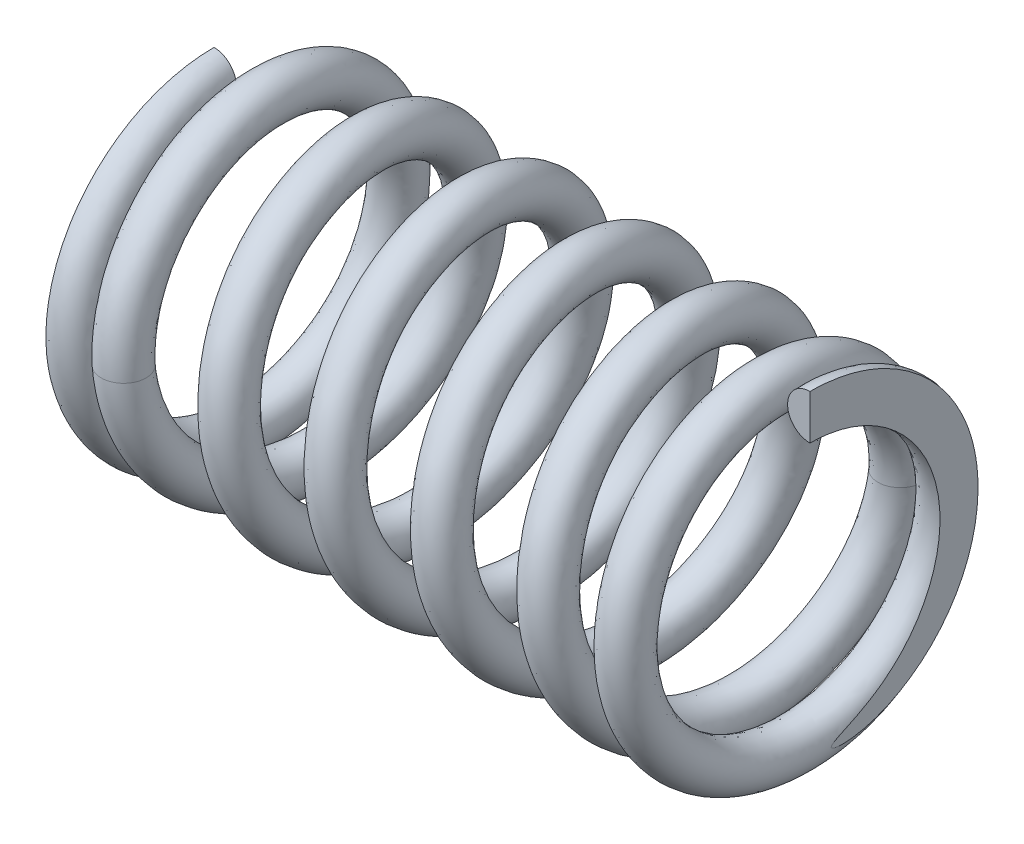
ISO-10303-21;
HEADER;
FILE_DESCRIPTION(('STEP AP214'),'2;1');
FILE_NAME('part.step','',(''),(''),'','','');
FILE_SCHEMA(('AUTOMOTIVE_DESIGN { 1 0 10303 214 1 1 1 1 }'));
ENDSEC;
DATA;
#1=APPLICATION_CONTEXT('core data for automotive mechanical design processes');
#2=APPLICATION_PROTOCOL_DEFINITION('international standard','automotive_design',2000,#1);
#3=PRODUCT_CONTEXT('',#1,'mechanical');
#4=PRODUCT('Part','Part','',(#3));
#5=PRODUCT_RELATED_PRODUCT_CATEGORY('part','',(#4));
#6=PRODUCT_DEFINITION_FORMATION('','',#4);
#7=PRODUCT_DEFINITION_CONTEXT('part definition',#1,'design');
#8=PRODUCT_DEFINITION('design','',#6,#7);
#9=PRODUCT_DEFINITION_SHAPE('','',#8);
#10=(LENGTH_UNIT() NAMED_UNIT(*) SI_UNIT(.MILLI.,.METRE.));
#11=(NAMED_UNIT(*) PLANE_ANGLE_UNIT() SI_UNIT($,.RADIAN.));
#12=(NAMED_UNIT(*) SI_UNIT($,.STERADIAN.) SOLID_ANGLE_UNIT());
#13=UNCERTAINTY_MEASURE_WITH_UNIT(LENGTH_MEASURE(1.E-05),#10,'distance_accuracy_value','');
#14=(GEOMETRIC_REPRESENTATION_CONTEXT(3) GLOBAL_UNCERTAINTY_ASSIGNED_CONTEXT((#13)) GLOBAL_UNIT_ASSIGNED_CONTEXT((#10,
#11,#12)) REPRESENTATION_CONTEXT('',''));
#15=CARTESIAN_POINT('',(0.,0.,0.));
#16=DIRECTION('',(0.,0.,1.));
#17=DIRECTION('',(1.,0.,0.));
#18=AXIS2_PLACEMENT_3D('',#15,#16,#17);
#19=CARTESIAN_POINT('',(20.,5.,4.89187768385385E-13));
#20=DIRECTION('',(0.,0.,1.));
#21=DIRECTION('',(0.,-1.,0.));
#22=AXIS2_PLACEMENT_3D('',#19,#20,#21);
#23=PLANE('',#22);
#24=CARTESIAN_POINT('',(20.,5.,4.89187768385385E-13));
#25=DIRECTION('',(0.,0.,1.));
#26=DIRECTION('',(0.,-1.,0.));
#27=AXIS2_PLACEMENT_3D('',#24,#25,#26);
#28=CIRCLE('',#27,0.750000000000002);
#29=CARTESIAN_POINT('',(20.,5.75,5.68530215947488E-13));
#30=VERTEX_POINT('',#29);
#31=CARTESIAN_POINT('',(20.,4.25,4.17155280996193E-13));
#32=VERTEX_POINT('',#31);
#33=EDGE_CURVE('E44',#30,#32,#28,.T.);
#34=ORIENTED_EDGE('',*,*,#33,.T.);
#35=DIRECTION('',(0.,1.,0.));
#36=VECTOR('',#35,1.);
#37=CARTESIAN_POINT('',(20.,5.,4.89187768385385E-13));
#38=LINE('',#37,#36);
#39=EDGE_CURVE('E81',#32,#30,#38,.T.);
#40=ORIENTED_EDGE('',*,*,#39,.T.);
#41=EDGE_LOOP('',(#34,#40));
#42=FACE_BOUND('',#41,.T.);
#43=ADVANCED_FACE('F40',(#42),#23,.T.);
#44=CARTESIAN_POINT('',(18.03125,3.4161562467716E-13,-4.25));
#45=CARTESIAN_POINT('',(18.1625,2.45373864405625,-4.2499999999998));
#46=CARTESIAN_POINT('',(18.29375,3.68060796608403,-2.1249999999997));
#47=CARTESIAN_POINT('',(18.425,4.90747728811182,3.94163249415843E-13));
#48=CARTESIAN_POINT('',(18.55625,3.68060796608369,2.12500000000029));
#49=CARTESIAN_POINT('',(18.6875,2.45373864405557,4.25000000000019));
#50=CARTESIAN_POINT('',(18.81875,-3.41095149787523E-13,4.25));
#51=CARTESIAN_POINT('',(18.95,-2.45373864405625,4.2499999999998));
#52=CARTESIAN_POINT('',(19.08125,-3.68060796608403,2.1249999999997));
#53=CARTESIAN_POINT('',(19.2125,-4.90747728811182,-3.93562256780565E-13));
#54=CARTESIAN_POINT('',(19.34375,-3.68060796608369,-2.12500000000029));
#55=CARTESIAN_POINT('',(19.475,-2.45373864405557,-4.25000000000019));
#56=CARTESIAN_POINT('',(19.60625,3.4161562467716E-13,-4.25));
#57=CARTESIAN_POINT('',(19.7375,2.45373864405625,-4.2499999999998));
#58=CARTESIAN_POINT('',(19.86875,3.68060796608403,-2.1249999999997));
#59=CARTESIAN_POINT('',(20.,4.90747728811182,3.94163249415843E-13));
#60=CARTESIAN_POINT('',(20.13125,3.68060796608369,2.12500000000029));
#61=CARTESIAN_POINT('',(20.2625,2.45373864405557,4.25000000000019));
#62=CARTESIAN_POINT('',(20.39375,-3.41095149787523E-13,4.25));
#63=CARTESIAN_POINT('',(20.525,-2.45373864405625,4.2499999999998));
#64=CARTESIAN_POINT('',(20.65625,-3.68060796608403,2.1249999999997));
#65=CARTESIAN_POINT('',(20.7875,-4.90747728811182,-3.93562256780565E-13));
#66=CARTESIAN_POINT('',(20.91875,-3.68060796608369,-2.12500000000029));
#67=CARTESIAN_POINT('',(21.05,-2.45373864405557,-4.25000000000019));
#68=CARTESIAN_POINT('',(21.18125,3.4161562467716E-13,-4.25));
#69=CARTESIAN_POINT('',(19.53125,3.41615624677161E-13,-4.25));
#70=CARTESIAN_POINT('',(19.6625,2.45373864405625,-4.2499999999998));
#71=CARTESIAN_POINT('',(19.79375,3.68060796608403,-2.1249999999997));
#72=CARTESIAN_POINT('',(19.925,4.90747728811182,3.94163249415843E-13));
#73=CARTESIAN_POINT('',(20.05625,3.68060796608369,2.12500000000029));
#74=CARTESIAN_POINT('',(20.1875,2.45373864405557,4.25000000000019));
#75=CARTESIAN_POINT('',(20.31875,-3.41095149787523E-13,4.25));
#76=CARTESIAN_POINT('',(20.45,-2.45373864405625,4.2499999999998));
#77=CARTESIAN_POINT('',(20.58125,-3.68060796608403,2.1249999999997));
#78=CARTESIAN_POINT('',(20.7125,-4.90747728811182,-3.93562256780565E-13));
#79=CARTESIAN_POINT('',(20.84375,-3.68060796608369,-2.12500000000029));
#80=CARTESIAN_POINT('',(20.975,-2.45373864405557,-4.25000000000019));
#81=CARTESIAN_POINT('',(21.10625,3.41615624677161E-13,-4.25));
#82=CARTESIAN_POINT('',(21.2375,2.45373864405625,-4.2499999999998));
#83=CARTESIAN_POINT('',(21.36875,3.68060796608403,-2.1249999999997));
#84=CARTESIAN_POINT('',(21.5,4.90747728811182,3.94163249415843E-13));
#85=CARTESIAN_POINT('',(21.63125,3.68060796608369,2.12500000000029));
#86=CARTESIAN_POINT('',(21.7625,2.45373864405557,4.25000000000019));
#87=CARTESIAN_POINT('',(21.89375,-3.41095149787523E-13,4.25));
#88=CARTESIAN_POINT('',(22.025,-2.45373864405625,4.2499999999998));
#89=CARTESIAN_POINT('',(22.15625,-3.68060796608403,2.1249999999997));
#90=CARTESIAN_POINT('',(22.2875,-4.90747728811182,-3.93562256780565E-13));
#91=CARTESIAN_POINT('',(22.41875,-3.68060796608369,-2.12500000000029));
#92=CARTESIAN_POINT('',(22.55,-2.45373864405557,-4.25000000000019));
#93=CARTESIAN_POINT('',(22.68125,3.41615624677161E-13,-4.25));
#94=CARTESIAN_POINT('',(19.53125,4.62185845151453E-13,-5.75));
#95=CARTESIAN_POINT('',(19.6625,3.31976404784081,-5.74999999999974));
#96=CARTESIAN_POINT('',(19.79375,4.97964607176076,-2.8749999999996));
#97=CARTESIAN_POINT('',(19.925,6.6395280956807,5.33279690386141E-13));
#98=CARTESIAN_POINT('',(20.05625,4.97964607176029,2.8750000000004));
#99=CARTESIAN_POINT('',(20.1875,3.31976404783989,5.75000000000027));
#100=CARTESIAN_POINT('',(20.31875,-4.61481673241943E-13,5.75));
#101=CARTESIAN_POINT('',(20.45,-3.31976404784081,5.74999999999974));
#102=CARTESIAN_POINT('',(20.58125,-4.97964607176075,2.8749999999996));
#103=CARTESIAN_POINT('',(20.7125,-6.6395280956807,-5.32466582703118E-13));
#104=CARTESIAN_POINT('',(20.84375,-4.9796460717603,-2.8750000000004));
#105=CARTESIAN_POINT('',(20.975,-3.31976404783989,-5.75000000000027));
#106=CARTESIAN_POINT('',(21.10625,4.62185845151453E-13,-5.75));
#107=CARTESIAN_POINT('',(21.2375,3.31976404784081,-5.74999999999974));
#108=CARTESIAN_POINT('',(21.36875,4.97964607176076,-2.8749999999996));
#109=CARTESIAN_POINT('',(21.5,6.6395280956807,5.33279690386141E-13));
#110=CARTESIAN_POINT('',(21.63125,4.97964607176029,2.8750000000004));
#111=CARTESIAN_POINT('',(21.7625,3.31976404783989,5.75000000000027));
#112=CARTESIAN_POINT('',(21.89375,-4.61481673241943E-13,5.75));
#113=CARTESIAN_POINT('',(22.025,-3.31976404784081,5.74999999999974));
#114=CARTESIAN_POINT('',(22.15625,-4.97964607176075,2.8749999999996));
#115=CARTESIAN_POINT('',(22.2875,-6.6395280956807,-5.32466582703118E-13));
#116=CARTESIAN_POINT('',(22.41875,-4.9796460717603,-2.8750000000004));
#117=CARTESIAN_POINT('',(22.55,-3.31976404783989,-5.75000000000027));
#118=CARTESIAN_POINT('',(22.68125,4.62185845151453E-13,-5.75));
#119=CARTESIAN_POINT('',(18.03125,4.62185845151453E-13,-5.75));
#120=CARTESIAN_POINT('',(18.1625,3.31976404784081,-5.74999999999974));
#121=CARTESIAN_POINT('',(18.29375,4.97964607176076,-2.8749999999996));
#122=CARTESIAN_POINT('',(18.425,6.6395280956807,5.33279690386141E-13));
#123=CARTESIAN_POINT('',(18.55625,4.97964607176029,2.8750000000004));
#124=CARTESIAN_POINT('',(18.6875,3.31976404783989,5.75000000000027));
#125=CARTESIAN_POINT('',(18.81875,-4.61481673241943E-13,5.75));
#126=CARTESIAN_POINT('',(18.95,-3.31976404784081,5.74999999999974));
#127=CARTESIAN_POINT('',(19.08125,-4.97964607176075,2.8749999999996));
#128=CARTESIAN_POINT('',(19.2125,-6.6395280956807,-5.32466582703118E-13));
#129=CARTESIAN_POINT('',(19.34375,-4.9796460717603,-2.8750000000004));
#130=CARTESIAN_POINT('',(19.475,-3.31976404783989,-5.75000000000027));
#131=CARTESIAN_POINT('',(19.60625,4.62185845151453E-13,-5.75));
#132=CARTESIAN_POINT('',(19.7375,3.31976404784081,-5.74999999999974));
#133=CARTESIAN_POINT('',(19.86875,4.97964607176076,-2.8749999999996));
#134=CARTESIAN_POINT('',(20.,6.6395280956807,5.33279690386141E-13));
#135=CARTESIAN_POINT('',(20.13125,4.97964607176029,2.8750000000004));
#136=CARTESIAN_POINT('',(20.2625,3.31976404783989,5.75000000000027));
#137=CARTESIAN_POINT('',(20.39375,-4.61481673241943E-13,5.75));
#138=CARTESIAN_POINT('',(20.525,-3.31976404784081,5.74999999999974));
#139=CARTESIAN_POINT('',(20.65625,-4.97964607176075,2.8749999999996));
#140=CARTESIAN_POINT('',(20.7875,-6.6395280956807,-5.32466582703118E-13));
#141=CARTESIAN_POINT('',(20.91875,-4.9796460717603,-2.8750000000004));
#142=CARTESIAN_POINT('',(21.05,-3.31976404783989,-5.75000000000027));
#143=CARTESIAN_POINT('',(21.18125,4.62185845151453E-13,-5.75));
#144=CARTESIAN_POINT('',(16.53125,4.62185845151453E-13,-5.75));
#145=CARTESIAN_POINT('',(16.6625,3.31976404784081,-5.74999999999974));
#146=CARTESIAN_POINT('',(16.79375,4.97964607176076,-2.8749999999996));
#147=CARTESIAN_POINT('',(16.925,6.6395280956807,5.33279690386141E-13));
#148=CARTESIAN_POINT('',(17.05625,4.97964607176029,2.8750000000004));
#149=CARTESIAN_POINT('',(17.1875,3.31976404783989,5.75000000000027));
#150=CARTESIAN_POINT('',(17.31875,-4.61481673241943E-13,5.75));
#151=CARTESIAN_POINT('',(17.45,-3.31976404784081,5.74999999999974));
#152=CARTESIAN_POINT('',(17.58125,-4.97964607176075,2.8749999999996));
#153=CARTESIAN_POINT('',(17.7125,-6.6395280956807,-5.32466582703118E-13));
#154=CARTESIAN_POINT('',(17.84375,-4.9796460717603,-2.8750000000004));
#155=CARTESIAN_POINT('',(17.975,-3.31976404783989,-5.75000000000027));
#156=CARTESIAN_POINT('',(18.10625,4.62185845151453E-13,-5.75));
#157=CARTESIAN_POINT('',(18.2375,3.31976404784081,-5.74999999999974));
#158=CARTESIAN_POINT('',(18.36875,4.97964607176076,-2.8749999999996));
#159=CARTESIAN_POINT('',(18.5,6.6395280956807,5.33279690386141E-13));
#160=CARTESIAN_POINT('',(18.63125,4.97964607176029,2.8750000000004));
#161=CARTESIAN_POINT('',(18.7625,3.31976404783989,5.75000000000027));
#162=CARTESIAN_POINT('',(18.89375,-4.61481673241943E-13,5.75));
#163=CARTESIAN_POINT('',(19.025,-3.31976404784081,5.74999999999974));
#164=CARTESIAN_POINT('',(19.15625,-4.97964607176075,2.8749999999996));
#165=CARTESIAN_POINT('',(19.2875,-6.6395280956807,-5.32466582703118E-13));
#166=CARTESIAN_POINT('',(19.41875,-4.9796460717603,-2.8750000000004));
#167=CARTESIAN_POINT('',(19.55,-3.31976404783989,-5.75000000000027));
#168=CARTESIAN_POINT('',(19.68125,4.62185845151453E-13,-5.75));
#169=CARTESIAN_POINT('',(16.53125,3.41615624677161E-13,-4.25));
#170=CARTESIAN_POINT('',(16.6625,2.45373864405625,-4.2499999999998));
#171=CARTESIAN_POINT('',(16.79375,3.68060796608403,-2.1249999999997));
#172=CARTESIAN_POINT('',(16.925,4.90747728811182,3.94163249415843E-13));
#173=CARTESIAN_POINT('',(17.05625,3.68060796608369,2.12500000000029));
#174=CARTESIAN_POINT('',(17.1875,2.45373864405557,4.25000000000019));
#175=CARTESIAN_POINT('',(17.31875,-3.41095149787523E-13,4.25));
#176=CARTESIAN_POINT('',(17.45,-2.45373864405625,4.2499999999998));
#177=CARTESIAN_POINT('',(17.58125,-3.68060796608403,2.1249999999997));
#178=CARTESIAN_POINT('',(17.7125,-4.90747728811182,-3.93562256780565E-13));
#179=CARTESIAN_POINT('',(17.84375,-3.68060796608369,-2.12500000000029));
#180=CARTESIAN_POINT('',(17.975,-2.45373864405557,-4.25000000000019));
#181=CARTESIAN_POINT('',(18.10625,3.41615624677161E-13,-4.25));
#182=CARTESIAN_POINT('',(18.2375,2.45373864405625,-4.2499999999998));
#183=CARTESIAN_POINT('',(18.36875,3.68060796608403,-2.1249999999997));
#184=CARTESIAN_POINT('',(18.5,4.90747728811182,3.94163249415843E-13));
#185=CARTESIAN_POINT('',(18.63125,3.68060796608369,2.12500000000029));
#186=CARTESIAN_POINT('',(18.7625,2.45373864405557,4.25000000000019));
#187=CARTESIAN_POINT('',(18.89375,-3.41095149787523E-13,4.25));
#188=CARTESIAN_POINT('',(19.025,-2.45373864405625,4.2499999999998));
#189=CARTESIAN_POINT('',(19.15625,-3.68060796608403,2.1249999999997));
#190=CARTESIAN_POINT('',(19.2875,-4.90747728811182,-3.93562256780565E-13));
#191=CARTESIAN_POINT('',(19.41875,-3.68060796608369,-2.12500000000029));
#192=CARTESIAN_POINT('',(19.55,-2.45373864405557,-4.25000000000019));
#193=CARTESIAN_POINT('',(19.68125,3.41615624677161E-13,-4.25));
#194=CARTESIAN_POINT('',(18.03125,3.4161562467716E-13,-4.25));
#195=CARTESIAN_POINT('',(18.1625,2.45373864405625,-4.2499999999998));
#196=CARTESIAN_POINT('',(18.29375,3.68060796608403,-2.1249999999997));
#197=CARTESIAN_POINT('',(18.425,4.90747728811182,3.94163249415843E-13));
#198=CARTESIAN_POINT('',(18.55625,3.68060796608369,2.12500000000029));
#199=CARTESIAN_POINT('',(18.6875,2.45373864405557,4.25000000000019));
#200=CARTESIAN_POINT('',(18.81875,-3.41095149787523E-13,4.25));
#201=CARTESIAN_POINT('',(18.95,-2.45373864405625,4.2499999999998));
#202=CARTESIAN_POINT('',(19.08125,-3.68060796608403,2.1249999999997));
#203=CARTESIAN_POINT('',(19.2125,-4.90747728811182,-3.93562256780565E-13));
#204=CARTESIAN_POINT('',(19.34375,-3.68060796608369,-2.12500000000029));
#205=CARTESIAN_POINT('',(19.475,-2.45373864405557,-4.25000000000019));
#206=CARTESIAN_POINT('',(19.60625,3.4161562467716E-13,-4.25));
#207=CARTESIAN_POINT('',(19.7375,2.45373864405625,-4.2499999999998));
#208=CARTESIAN_POINT('',(19.86875,3.68060796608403,-2.1249999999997));
#209=CARTESIAN_POINT('',(20.,4.90747728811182,3.94163249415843E-13));
#210=CARTESIAN_POINT('',(20.13125,3.68060796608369,2.12500000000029));
#211=CARTESIAN_POINT('',(20.2625,2.45373864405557,4.25000000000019));
#212=CARTESIAN_POINT('',(20.39375,-3.41095149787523E-13,4.25));
#213=CARTESIAN_POINT('',(20.525,-2.45373864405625,4.2499999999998));
#214=CARTESIAN_POINT('',(20.65625,-3.68060796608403,2.1249999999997));
#215=CARTESIAN_POINT('',(20.7875,-4.90747728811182,-3.93562256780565E-13));
#216=CARTESIAN_POINT('',(20.91875,-3.68060796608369,-2.12500000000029));
#217=CARTESIAN_POINT('',(21.05,-2.45373864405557,-4.25000000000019));
#218=CARTESIAN_POINT('',(21.18125,3.4161562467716E-13,-4.25));
#219=(BOUNDED_SURFACE() B_SPLINE_SURFACE(3,2,((#44,#45,#46,#47,#48,#49,#50,#51,#52,#53,#54,#55,
#56,#57,#58,#59,#60,#61,#62,#63,#64,#65,#66,#67,#68),(#69,#70,#71,#72,#73,#74,#75,#76,#77,#78,
#79,#80,#81,#82,#83,#84,#85,#86,#87,#88,#89,#90,#91,#92,#93),(#94,#95,#96,#97,#98,#99,#100,#101,
#102,#103,#104,#105,#106,#107,#108,#109,#110,#111,#112,#113,#114,#115,#116,#117,#118),(#119,
#120,#121,#122,#123,#124,#125,#126,#127,#128,#129,#130,#131,#132,#133,#134,#135,#136,#137,#138,
#139,#140,#141,#142,#143),(#144,#145,#146,#147,#148,#149,#150,#151,#152,#153,#154,#155,#156,
#157,#158,#159,#160,#161,#162,#163,#164,#165,#166,#167,#168),(#169,#170,#171,#172,#173,#174,
#175,#176,#177,#178,#179,#180,#181,#182,#183,#184,#185,#186,#187,#188,#189,#190,#191,#192,#193),
(#194,#195,#196,#197,#198,#199,#200,#201,#202,#203,#204,#205,#206,#207,#208,#209,#210,#211,#212,
#213,#214,#215,#216,#217,#218)),.UNSPECIFIED.,.T.,.F.,.F.) B_SPLINE_SURFACE_WITH_KNOTS((4,3,4),
(3,2,2,2,2,2,2,2,2,2,2,2,3),(0.,0.5,1.),(0.,0.0833333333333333,0.166666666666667,0.25,
0.333333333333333,0.416666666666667,0.5,0.583333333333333,0.666666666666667,0.75,
0.833333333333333,0.916666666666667,1.),
.UNSPECIFIED.) GEOMETRIC_REPRESENTATION_ITEM() RATIONAL_B_SPLINE_SURFACE(((1.,0.866025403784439,
1.,0.866025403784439,1.,0.866025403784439,1.,0.866025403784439,1.,0.866025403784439,1.,
0.866025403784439,1.,0.866025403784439,1.,0.866025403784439,1.,0.866025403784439,1.,
0.866025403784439,1.,0.866025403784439,1.,0.866025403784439,1.),(0.333333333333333,
0.288675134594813,0.333333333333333,0.288675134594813,0.333333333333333,0.288675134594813,
0.333333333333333,0.288675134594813,0.333333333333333,0.288675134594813,0.333333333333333,
0.288675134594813,0.333333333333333,0.288675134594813,0.333333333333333,0.288675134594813,
0.333333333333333,0.288675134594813,0.333333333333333,0.288675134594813,0.333333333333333,
0.288675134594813,0.333333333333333,0.288675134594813,0.333333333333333),(0.333333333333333,
0.288675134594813,0.333333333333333,0.288675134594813,0.333333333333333,0.288675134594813,
0.333333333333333,0.288675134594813,0.333333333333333,0.288675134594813,0.333333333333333,
0.288675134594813,0.333333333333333,0.288675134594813,0.333333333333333,0.288675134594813,
0.333333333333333,0.288675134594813,0.333333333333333,0.288675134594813,0.333333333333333,
0.288675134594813,0.333333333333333,0.288675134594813,0.333333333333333),(1.,0.866025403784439,
1.,0.866025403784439,1.,0.866025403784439,1.,0.866025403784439,1.,0.866025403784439,1.,
0.866025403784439,1.,0.866025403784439,1.,0.866025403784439,1.,0.866025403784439,1.,
0.866025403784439,1.,0.866025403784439,1.,0.866025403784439,1.),(0.333333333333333,
0.288675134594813,0.333333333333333,0.288675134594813,0.333333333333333,0.288675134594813,
0.333333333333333,0.288675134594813,0.333333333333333,0.288675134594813,0.333333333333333,
0.288675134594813,0.333333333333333,0.288675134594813,0.333333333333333,0.288675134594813,
0.333333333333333,0.288675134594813,0.333333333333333,0.288675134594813,0.333333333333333,
0.288675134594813,0.333333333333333,0.288675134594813,0.333333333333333),(0.333333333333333,
0.288675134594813,0.333333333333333,0.288675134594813,0.333333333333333,0.288675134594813,
0.333333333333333,0.288675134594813,0.333333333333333,0.288675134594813,0.333333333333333,
0.288675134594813,0.333333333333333,0.288675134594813,0.333333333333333,0.288675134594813,
0.333333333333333,0.288675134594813,0.333333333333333,0.288675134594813,0.333333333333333,
0.288675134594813,0.333333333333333,0.288675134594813,0.333333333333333),(1.,0.866025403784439,
1.,0.866025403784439,1.,0.866025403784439,1.,0.866025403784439,1.,0.866025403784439,1.,
0.866025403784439,1.,0.866025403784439,1.,0.866025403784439,1.,0.866025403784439,1.,
0.866025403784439,1.,0.866025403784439,1.,0.866025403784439,1.))) REPRESENTATION_ITEM('') SURFACE());
#220=CARTESIAN_POINT('',(18.03125,4.0152035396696E-13,-5.));
#221=DIRECTION('',(0.,1.,0.));
#222=DIRECTION('',(0.,0.,1.));
#223=AXIS2_PLACEMENT_3D('',#220,#221,#222);
#224=CIRCLE('',#223,0.75);
#225=CARTESIAN_POINT('',(18.03125,3.41292300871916E-13,-4.25));
#226=VERTEX_POINT('',#225);
#227=EDGE_CURVE('E230',#226,#226,#224,.T.);
#228=CARTESIAN_POINT('',(20.,5.75,5.68530215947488E-13));
#229=CARTESIAN_POINT('',(20.,5.74999724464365,-0.12607588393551));
#230=CARTESIAN_POINT('',(20.,5.7457847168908,-0.252103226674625));
#231=CARTESIAN_POINT('',(20.,5.72896248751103,-0.503575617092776));
#232=CARTESIAN_POINT('',(20.,5.71635414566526,-0.629020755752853));
#233=CARTESIAN_POINT('',(20.,5.66595185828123,-1.00392844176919));
#234=CARTESIAN_POINT('',(20.,5.61558068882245,-1.25184958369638));
#235=CARTESIAN_POINT('',(20.,5.50684064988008,-1.64910360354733));
#236=CARTESIAN_POINT('',(20.,5.45820147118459,-1.80120740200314));
#237=CARTESIAN_POINT('',(20.,5.34825868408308,-2.10083442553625));
#238=CARTESIAN_POINT('',(20.,5.28695298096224,-2.24835688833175));
#239=CARTESIAN_POINT('',(20.,5.15213646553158,-2.53773374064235));
#240=CARTESIAN_POINT('',(20.,5.07862361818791,-2.67958718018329));
#241=CARTESIAN_POINT('',(20.,4.91990546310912,-2.95659456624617));
#242=CARTESIAN_POINT('',(20.,4.83470052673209,-3.09174872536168));
#243=CARTESIAN_POINT('',(20.,4.65319031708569,-3.35421069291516));
#244=CARTESIAN_POINT('',(20.,4.5568948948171,-3.48152531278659));
#245=CARTESIAN_POINT('',(20.,4.35388434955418,-3.72745992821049));
#246=CARTESIAN_POINT('',(20.,4.2471739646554,-3.84608383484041));
#247=CARTESIAN_POINT('',(20.,4.02401037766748,-4.0738610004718));
#248=CARTESIAN_POINT('',(20.,3.90755397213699,-4.18301112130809));
#249=CARTESIAN_POINT('',(20.,3.66580610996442,-4.39095214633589));
#250=CARTESIAN_POINT('',(20.,3.54051788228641,-4.48974680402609));
#251=CARTESIAN_POINT('',(20.,3.28316371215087,-4.6754280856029));
#252=CARTESIAN_POINT('',(20.,3.15117092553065,-4.76241611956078));
#253=CARTESIAN_POINT('',(20.,2.88035080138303,-4.92488274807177));
#254=CARTESIAN_POINT('',(20.,2.74152610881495,-5.00036575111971));
#255=CARTESIAN_POINT('',(20.,2.45792510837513,-5.1393423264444));
#256=CARTESIAN_POINT('',(20.,2.31314625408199,-5.20283070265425));
#257=CARTESIAN_POINT('',(20.,2.01878631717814,-5.31729519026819));
#258=CARTESIAN_POINT('',(20.,1.86920704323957,-5.3682759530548));
#259=CARTESIAN_POINT('',(20.,1.56693717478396,-5.45719195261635));
#260=CARTESIAN_POINT('',(20.,1.41426323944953,-5.49518381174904));
#261=CARTESIAN_POINT('',(20.,1.10625693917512,-5.55816734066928));
#262=CARTESIAN_POINT('',(20.,0.950924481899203,-5.58315855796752));
#263=CARTESIAN_POINT('',(20.,0.638686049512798,-5.61997027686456));
#264=CARTESIAN_POINT('',(20.,0.481780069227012,-5.63179073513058));
#265=CARTESIAN_POINT('',(20.,0.24613565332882,-5.63959375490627));
#266=CARTESIAN_POINT('',(20.,0.167532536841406,-5.64053977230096));
#267=CARTESIAN_POINT('',(20.,0.0103551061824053,-5.63912558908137));
#268=CARTESIAN_POINT('',(20.,-0.0682192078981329,-5.6367653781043));
#269=CARTESIAN_POINT('',(20.,-0.303653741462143,-5.62456841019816));
#270=CARTESIAN_POINT('',(20.,-0.460280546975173,-5.60961724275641));
#271=CARTESIAN_POINT('',(20.,-0.771625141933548,-5.56617573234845));
#272=CARTESIAN_POINT('',(20.,-0.92634291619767,-5.53768528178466));
#273=CARTESIAN_POINT('',(20.,-1.23263949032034,-5.46732502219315));
#274=CARTESIAN_POINT('',(20.,-1.38421968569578,-5.4254613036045));
#275=CARTESIAN_POINT('',(20.,-1.68318539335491,-5.3285934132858));
#276=CARTESIAN_POINT('',(20.,-1.83056933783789,-5.27358440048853));
#277=CARTESIAN_POINT('',(20.,-2.11498092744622,-5.15289185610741));
#278=CARTESIAN_POINT('',(20.,-2.25219034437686,-5.08763636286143));
#279=CARTESIAN_POINT('',(20.,-2.52052397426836,-4.9456293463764));
#280=CARTESIAN_POINT('',(20.,-2.65164836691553,-4.86887816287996));
#281=CARTESIAN_POINT('',(20.,-2.90687910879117,-4.70434023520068));
#282=CARTESIAN_POINT('',(20.,-3.0309817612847,-4.61654775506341));
#283=CARTESIAN_POINT('',(20.,-3.27106677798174,-4.43059493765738));
#284=CARTESIAN_POINT('',(20.,-3.38705309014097,-4.33243970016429));
#285=CARTESIAN_POINT('',(20.,-3.60790685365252,-4.12837550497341));
#286=CARTESIAN_POINT('',(20.,-3.71294456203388,-4.02265079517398));
#287=CARTESIAN_POINT('',(20.,-3.91349648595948,-3.80260165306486));
#288=CARTESIAN_POINT('',(20.,-4.00901470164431,-3.68828086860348));
#289=CARTESIAN_POINT('',(20.,-4.18974384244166,-3.45185267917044));
#290=CARTESIAN_POINT('',(20.,-4.27495994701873,-3.32974923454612));
#291=CARTESIAN_POINT('',(20.,-4.43434875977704,-3.07856622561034));
#292=CARTESIAN_POINT('',(19.9999999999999,-4.50852427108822,-2.94948844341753));
#293=CARTESIAN_POINT('',(20.,-4.62632810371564,-2.72185095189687));
#294=CARTESIAN_POINT('',(20.0000000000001,-4.67273217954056,-2.62471995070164));
#295=CARTESIAN_POINT('',(19.9999999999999,-4.75850388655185,-2.4273712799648));
#296=CARTESIAN_POINT('',(19.9999999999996,-4.79787132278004,-2.32715352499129));
#297=CARTESIAN_POINT('',(20.0000000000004,-4.86908085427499,-2.12406740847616));
#298=CARTESIAN_POINT('',(20.0000000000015,-4.90092216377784,-2.02119877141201));
#299=CARTESIAN_POINT('',(19.9999999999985,-4.95632586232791,-1.81329085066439));
#300=CARTESIAN_POINT('',(19.9999999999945,-4.97989413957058,-1.70825316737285));
#301=CARTESIAN_POINT('',(19.9999999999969,-5.00807502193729,-1.54964927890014));
#302=CARTESIAN_POINT('',(19.9999999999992,-5.01626476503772,-1.4967063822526));
#303=CARTESIAN_POINT('',(20.0000000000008,-5.03000761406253,-1.39044021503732));
#304=CARTESIAN_POINT('',(20.0000000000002,-5.0355590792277,-1.33711672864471));
#305=CARTESIAN_POINT('',(19.9999999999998,-5.04357823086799,-1.23035486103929));
#306=CARTESIAN_POINT('',(20.,-5.04605370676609,-1.1769171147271));
#307=CARTESIAN_POINT('',(20.,-5.04679527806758,-1.09676691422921));
#308=CARTESIAN_POINT('',(20.,-5.04654819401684,-1.07006667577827));
#309=CARTESIAN_POINT('',(20.,-5.04484746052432,-1.01670706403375));
#310=CARTESIAN_POINT('',(20.,-5.0433942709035,-0.990047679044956));
#311=CARTESIAN_POINT('',(20.,-5.04002232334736,-0.950168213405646));
#312=CARTESIAN_POINT('',(20.,-5.03870022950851,-0.936897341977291));
#313=CARTESIAN_POINT('',(20.,-5.03557345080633,-0.910404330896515));
#314=CARTESIAN_POINT('',(19.9999999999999,-5.03376853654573,-0.897182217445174));
#315=CARTESIAN_POINT('',(20.0000000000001,-5.02955537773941,-0.870851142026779));
#316=CARTESIAN_POINT('',(20.0000000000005,-5.02714792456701,-0.857742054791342));
#317=CARTESIAN_POINT('',(19.9999999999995,-5.02152806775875,-0.83170084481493));
#318=CARTESIAN_POINT('',(19.9999999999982,-5.01831649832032,-0.818768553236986));
#319=CARTESIAN_POINT('',(19.9999999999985,-5.01140814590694,-0.795644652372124));
#320=CARTESIAN_POINT('',(19.9999999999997,-5.00791420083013,-0.785392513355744));
#321=CARTESIAN_POINT('',(20.0000000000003,-4.99971316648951,-0.765320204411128));
#322=CARTESIAN_POINT('',(19.9999999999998,-4.99500546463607,-0.755500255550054));
#323=CARTESIAN_POINT('',(19.9999999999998,-4.98628371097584,-0.74168618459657));
#324=CARTESIAN_POINT('',(20.,-4.98306881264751,-0.73720365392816));
#325=CARTESIAN_POINT('',(20.,-4.97587448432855,-0.728932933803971));
#326=CARTESIAN_POINT('',(20.,-4.97190316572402,-0.725138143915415));
#327=CARTESIAN_POINT('',(19.9999999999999,-4.96348851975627,-0.719236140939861));
#328=CARTESIAN_POINT('',(19.9999999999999,-4.9591570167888,-0.716982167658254));
#329=CARTESIAN_POINT('',(20.0000000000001,-4.94991291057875,-0.714186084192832));
#330=CARTESIAN_POINT('',(20.0000000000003,-4.94499711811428,-0.71365386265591));
#331=CARTESIAN_POINT('',(19.9999999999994,-4.93475042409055,-0.714362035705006));
#332=CARTESIAN_POINT('',(19.9999999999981,-4.92944056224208,-0.715822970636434));
#333=CARTESIAN_POINT('',(19.9999999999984,-4.92031049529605,-0.719637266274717));
#334=CARTESIAN_POINT('',(19.9999999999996,-4.9163925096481,-0.721788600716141));
#335=CARTESIAN_POINT('',(20.0000000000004,-4.90889163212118,-0.726621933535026));
#336=CARTESIAN_POINT('',(20.0000000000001,-4.90530959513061,-0.729305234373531));
#337=CARTESIAN_POINT('',(19.9999999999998,-4.89659337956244,-0.736520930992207));
#338=CARTESIAN_POINT('',(20.,-4.89164902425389,-0.741276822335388));
#339=CARTESIAN_POINT('',(20.,-4.88222345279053,-0.751208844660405));
#340=CARTESIAN_POINT('',(20.,-4.87774207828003,-0.756384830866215));
#341=CARTESIAN_POINT('',(20.,-4.86907980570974,-0.76704000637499));
#342=CARTESIAN_POINT('',(20.0000000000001,-4.8649012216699,-0.772521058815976));
#343=CARTESIAN_POINT('',(19.9999999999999,-4.8567964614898,-0.783661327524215));
#344=CARTESIAN_POINT('',(19.9999999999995,-4.85287018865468,-0.789320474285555));
#345=CARTESIAN_POINT('',(19.999999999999,-4.8402778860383,-0.808121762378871));
#346=CARTESIAN_POINT('',(19.9999999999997,-4.83200923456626,-0.821528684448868));
#347=CARTESIAN_POINT('',(20.0000000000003,-4.81605076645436,-0.848684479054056));
#348=CARTESIAN_POINT('',(20.0000000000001,-4.80836132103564,-0.862433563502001));
#349=CARTESIAN_POINT('',(19.9999999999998,-4.78581941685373,-0.904020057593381));
#350=CARTESIAN_POINT('',(20.,-4.77151903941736,-0.93215483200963));
#351=CARTESIAN_POINT('',(20.,-4.74357168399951,-0.988680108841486));
#352=CARTESIAN_POINT('',(20.,-4.72992368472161,-1.01707012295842));
#353=CARTESIAN_POINT('',(20.,-4.70290519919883,-1.07394652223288));
#354=CARTESIAN_POINT('',(20.,-4.68953444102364,-1.1024327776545));
#355=CARTESIAN_POINT('',(20.,-4.64948841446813,-1.1878813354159));
#356=CARTESIAN_POINT('',(20.,-4.62286358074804,-1.24486696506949));
#357=CARTESIAN_POINT('',(20.,-4.56884892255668,-1.35847688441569));
#358=CARTESIAN_POINT('',(20.,-4.54145911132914,-1.41510118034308));
#359=CARTESIAN_POINT('',(20.,-4.48549245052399,-1.52778142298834));
#360=CARTESIAN_POINT('',(20.,-4.45691529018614,-1.58383721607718));
#361=CARTESIAN_POINT('',(20.,-4.39833867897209,-1.69520011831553));
#362=CARTESIAN_POINT('',(20.,-4.36833928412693,-1.75050725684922));
#363=CARTESIAN_POINT('',(20.,-4.30681336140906,-1.86017675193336));
#364=CARTESIAN_POINT('',(20.,-4.27528878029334,-1.91454019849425));
#365=CARTESIAN_POINT('',(20.,-4.21059190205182,-2.02228047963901));
#366=CARTESIAN_POINT('',(20.,-4.17741956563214,-2.07565729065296));
#367=CARTESIAN_POINT('',(20.,-4.10937230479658,-2.18132500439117));
#368=CARTESIAN_POINT('',(20.,-4.07449718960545,-2.23361578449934));
#369=CARTESIAN_POINT('',(20.,-4.02089828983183,-2.31115995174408));
#370=CARTESIAN_POINT('',(20.,-4.00281772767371,-2.33685919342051));
#371=CARTESIAN_POINT('',(20.,-3.96616882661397,-2.3879077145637));
#372=CARTESIAN_POINT('',(20.,-3.94760047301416,-2.41325698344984));
#373=CARTESIAN_POINT('',(20.,-3.85276276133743,-2.54019242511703));
#374=CARTESIAN_POINT('',(20.,-3.77281817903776,-2.6390811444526));
#375=CARTESIAN_POINT('',(20.,-3.60551644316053,-2.83034894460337));
#376=CARTESIAN_POINT('',(20.,-3.51815937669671,-2.92272810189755));
#377=CARTESIAN_POINT('',(20.,-3.33634935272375,-3.10049304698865));
#378=CARTESIAN_POINT('',(20.,-3.24188674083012,-3.18586897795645));
#379=CARTESIAN_POINT('',(20.,-3.04649696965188,-3.3488866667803));
#380=CARTESIAN_POINT('',(20.,-2.94556926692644,-3.42652777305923));
#381=CARTESIAN_POINT('',(20.,-2.7298223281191,-3.57919193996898));
#382=CARTESIAN_POINT('',(20.,-2.61453208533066,-3.65355096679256));
#383=CARTESIAN_POINT('',(20.,-2.37794454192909,-3.7920181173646));
#384=CARTESIAN_POINT('',(20.,-2.25664694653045,-3.85612573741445));
#385=CARTESIAN_POINT('',(20.,-2.00891672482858,-3.97353312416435));
#386=CARTESIAN_POINT('',(20.,-1.88248376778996,-4.02683219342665));
#387=CARTESIAN_POINT('',(20.,-1.62543073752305,-4.12213335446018));
#388=CARTESIAN_POINT('',(20.,-1.49481080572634,-4.1641358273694));
#389=CARTESIAN_POINT('',(20.,-1.23458170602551,-4.23529512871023));
#390=CARTESIAN_POINT('',(20.,-1.10507255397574,-4.26481807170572));
#391=CARTESIAN_POINT('',(20.,-0.843985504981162,-4.31262164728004));
#392=CARTESIAN_POINT('',(20.,-0.712407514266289,-4.33090176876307));
#393=CARTESIAN_POINT('',(20.,-0.44821737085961,-4.35600280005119));
#394=CARTESIAN_POINT('',(20.,-0.315605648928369,-4.3628282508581));
#395=CARTESIAN_POINT('',(20.,-0.0502923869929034,-4.36494423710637));
#396=CARTESIAN_POINT('',(20.,0.0824091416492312,-4.36023602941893));
#397=CARTESIAN_POINT('',(20.,0.343072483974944,-4.33908940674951));
#398=CARTESIAN_POINT('',(20.,0.471061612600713,-4.32298904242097));
#399=CARTESIAN_POINT('',(20.,0.725140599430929,-4.27964488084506));
#400=CARTESIAN_POINT('',(20.,0.851230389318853,-4.25240068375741));
#401=CARTESIAN_POINT('',(20.,1.1005093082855,-4.18698164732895));
#402=CARTESIAN_POINT('',(20.,1.22369913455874,-4.14880946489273));
#403=CARTESIAN_POINT('',(20.,1.46631417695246,-4.06182018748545));
#404=CARTESIAN_POINT('',(20.,1.5857379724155,-4.01299912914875));
#405=CARTESIAN_POINT('',(20.,1.81533288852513,-3.90718084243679));
#406=CARTESIAN_POINT('',(20.,1.92568322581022,-3.85057198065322));
#407=CARTESIAN_POINT('',(20.,2.14126895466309,-3.72824628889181));
#408=CARTESIAN_POINT('',(20.,2.24650248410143,-3.66252617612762));
#409=CARTESIAN_POINT('',(20.,2.45101694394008,-3.52248047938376));
#410=CARTESIAN_POINT('',(20.,2.55030026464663,-3.44815838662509));
#411=CARTESIAN_POINT('',(20.,2.7422766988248,-3.29138210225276));
#412=CARTESIAN_POINT('',(20.,2.83496755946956,-3.20892515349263));
#413=CARTESIAN_POINT('',(20.,3.01301450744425,-3.03650164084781));
#414=CARTESIAN_POINT('',(20.,3.09837402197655,-2.94653862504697));
#415=CARTESIAN_POINT('',(20.,3.26118598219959,-2.75970913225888));
#416=CARTESIAN_POINT('',(20.,3.33863468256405,-2.66283942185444));
#417=CARTESIAN_POINT('',(20.,3.55821785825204,-2.36285107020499));
#418=CARTESIAN_POINT('',(20.,3.68777156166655,-2.15017663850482));
#419=CARTESIAN_POINT('',(20.,3.85272968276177,-1.81812703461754));
#420=CARTESIAN_POINT('',(20.,3.90269536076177,-1.7056894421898));
#421=CARTESIAN_POINT('',(20.,3.99287895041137,-1.47697051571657));
#422=CARTESIAN_POINT('',(20.,4.03310043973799,-1.36069061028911));
#423=CARTESIAN_POINT('',(20.,4.10347407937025,-1.12525303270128));
#424=CARTESIAN_POINT('',(20.,4.13363534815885,-1.00609807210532));
#425=CARTESIAN_POINT('',(20.,4.18373348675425,-0.765703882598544));
#426=CARTESIAN_POINT('',(20.,4.20367513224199,-0.644465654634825));
#427=CARTESIAN_POINT('',(20.,4.22896186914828,-0.435853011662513));
#428=CARTESIAN_POINT('',(20.,4.23685646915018,-0.348778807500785));
#429=CARTESIAN_POINT('',(20.,4.24737168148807,-0.174472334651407));
#430=CARTESIAN_POINT('',(20.0000000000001,4.25000190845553,-0.0872406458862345));
#431=CARTESIAN_POINT('',(20.0000000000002,4.25,4.38206938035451E-13));
#432=B_SPLINE_CURVE_WITH_KNOTS('',3,(#228,#229,#230,#231,#232,#233,#234,#235,#236,#237,#238,
#239,#240,#241,#242,#243,#244,#245,#246,#247,#248,#249,#250,#251,#252,#253,#254,#255,#256,#257,
#258,#259,#260,#261,#262,#263,#264,#265,#266,#267,#268,#269,#270,#271,#272,#273,#274,#275,#276,
#277,#278,#279,#280,#281,#282,#283,#284,#285,#286,#287,#288,#289,#290,#291,#292,#293,#294,#295,
#296,#297,#298,#299,#300,#301,#302,#303,#304,#305,#306,#307,#308,#309,#310,#311,#312,#313,#314,
#315,#316,#317,#318,#319,#320,#321,#322,#323,#324,#325,#326,#327,#328,#329,#330,#331,#332,#333,
#334,#335,#336,#337,#338,#339,#340,#341,#342,#343,#344,#345,#346,#347,#348,#349,#350,#351,#352,
#353,#354,#355,#356,#357,#358,#359,#360,#361,#362,#363,#364,#365,#366,#367,#368,#369,#370,#371,
#372,#373,#374,#375,#376,#377,#378,#379,#380,#381,#382,#383,#384,#385,#386,#387,#388,#389,#390,
#391,#392,#393,#394,#395,#396,#397,#398,#399,#400,#401,#402,#403,#404,#405,#406,#407,#408,#409,
#410,#411,#412,#413,#414,#415,#416,#417,#418,#419,#420,#421,#422,#423,#424,#425,#426,#427,#428,
#429,#430,#431),.UNSPECIFIED.,.F.,.F.,(4,2,2,2,2,2,2,2,2,2,2,2,2,2,2,2,2,2,2,2,2,2,2,2,2,2,2,2,
2,2,2,2,2,2,2,2,2,2,2,2,2,2,2,2,2,2,2,2,2,2,2,2,2,2,2,2,2,2,2,2,2,2,2,2,2,2,2,2,2,2,2,2,2,2,2,2,
2,2,2,2,2,2,2,2,2,2,2,2,2,2,2,2,2,2,2,2,2,2,2,2,2,4),(0.,0.378060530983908,0.756059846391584,
1.51239685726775,1.99098848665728,2.46965932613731,2.94841004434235,3.4271455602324,
3.90545907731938,4.38355599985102,4.86181069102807,5.33989142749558,5.81356348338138,
6.28705357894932,6.76074832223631,7.23426663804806,7.70569361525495,8.17713699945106,
8.64858193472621,8.88434873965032,9.12011628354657,9.5914868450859,10.062861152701,
10.5340210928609,11.005354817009,11.4606137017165,11.9158591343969,12.3713420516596,
12.8266018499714,13.2731525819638,13.7195148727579,14.1656518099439,14.6116752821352,
14.9343878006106,15.257109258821,15.5798643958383,15.90238934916,16.0630541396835,
16.2238187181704,16.3841753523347,16.4642611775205,16.5443164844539,16.5843198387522,
16.6243422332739,16.6643123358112,16.7042411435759,16.736708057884,16.7691913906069,
16.785685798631,16.8020123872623,16.8164028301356,16.8308757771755,16.8470867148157,
16.8604479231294,16.8738422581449,16.8943728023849,16.9148963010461,16.9355629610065,
16.956221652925,17.0034453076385,17.0506989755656,17.1453534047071,17.2398544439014,
17.334257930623,17.5229536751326,17.7116461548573,17.9003883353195,18.0891230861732,
18.27762298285,18.4661273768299,18.6546529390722,18.7489146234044,18.8431791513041,
19.224237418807,19.6052912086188,19.9868724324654,20.3684857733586,20.7795385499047,
21.1906115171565,21.6017110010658,22.0127966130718,22.4108057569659,22.808832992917,
23.2067024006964,23.6045284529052,23.9910192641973,24.3775239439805,24.7639347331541,
25.1504895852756,25.522122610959,25.8938898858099,26.2655067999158,26.6372501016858,
27.0088186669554,27.3805623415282,28.1232977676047,28.4920770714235,28.8607207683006,
29.2290294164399,29.597165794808,29.8593095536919,30.1209741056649),.UNSPECIFIED.);
#433=EDGE_CURVE('E12',#30,#32,#432,.T.);
#434=ORIENTED_EDGE('',*,*,#227,.T.);
#435=EDGE_LOOP('',(#434));
#436=FACE_BOUND('',#435,.T.);
#437=ORIENTED_EDGE('',*,*,#33,.F.);
#438=ORIENTED_EDGE('',*,*,#433,.T.);
#439=EDGE_LOOP('',(#437,#438));
#440=FACE_BOUND('',#439,.T.);
#441=ADVANCED_FACE('F90',(#436,#440),#219,.T.);
#442=CARTESIAN_POINT('',(0.,5.,0.));
#443=DIRECTION('',(0.,0.,1.));
#444=DIRECTION('',(1.,0.,0.));
#445=AXIS2_PLACEMENT_3D('',#442,#443,#444);
#446=PLANE('',#445);
#447=CARTESIAN_POINT('',(0.,5.,0.));
#448=DIRECTION('',(0.,0.,1.));
#449=DIRECTION('',(1.,0.,0.));
#450=AXIS2_PLACEMENT_3D('',#447,#448,#449);
#451=CIRCLE('',#450,0.75);
#452=CARTESIAN_POINT('',(0.,4.25,0.));
#453=VERTEX_POINT('',#452);
#454=CARTESIAN_POINT('',(0.75,5.,0.));
#455=VERTEX_POINT('',#454);
#456=EDGE_CURVE('E240',#453,#455,#451,.T.);
#457=ORIENTED_EDGE('',*,*,#456,.F.);
#458=DIRECTION('',(0.,1.,0.));
#459=VECTOR('',#458,1.);
#460=CARTESIAN_POINT('',(0.,5.,0.));
#461=LINE('',#460,#459);
#462=CARTESIAN_POINT('',(0.,5.75,0.));
#463=VERTEX_POINT('',#462);
#464=EDGE_CURVE('E87',#453,#463,#461,.T.);
#465=ORIENTED_EDGE('',*,*,#464,.T.);
#466=EDGE_CURVE('E226',#455,#463,#451,.T.);
#467=ORIENTED_EDGE('',*,*,#466,.F.);
#468=EDGE_LOOP('',(#457,#465,#467));
#469=FACE_BOUND('',#468,.T.);
#470=ADVANCED_FACE('F42',(#469),#446,.F.);
#471=CARTESIAN_POINT('',(0.75,5.,0.));
#472=CARTESIAN_POINT('',(0.88125,5.,2.88675134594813));
#473=CARTESIAN_POINT('',(1.0125,2.5,4.33012701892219));
#474=CARTESIAN_POINT('',(1.14375,0.,5.77350269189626));
#475=CARTESIAN_POINT('',(1.275,-2.5,4.33012701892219));
#476=CARTESIAN_POINT('',(1.40625,-5.,2.88675134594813));
#477=CARTESIAN_POINT('',(1.5375,-5.,0.));
#478=CARTESIAN_POINT('',(1.66875,-5.,-2.88675134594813));
#479=CARTESIAN_POINT('',(1.8,-2.5,-4.33012701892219));
#480=CARTESIAN_POINT('',(1.93125,0.,-5.77350269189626));
#481=CARTESIAN_POINT('',(2.0625,2.5,-4.3301270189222));
#482=CARTESIAN_POINT('',(2.19375,5.,-2.88675134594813));
#483=CARTESIAN_POINT('',(2.325,5.,0.));
#484=CARTESIAN_POINT('',(2.45625,5.,2.88675134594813));
#485=CARTESIAN_POINT('',(2.5875,2.5,4.33012701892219));
#486=CARTESIAN_POINT('',(2.71875,0.,5.77350269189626));
#487=CARTESIAN_POINT('',(2.84999999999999,-2.5,4.33012701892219));
#488=CARTESIAN_POINT('',(2.98125,-5.,2.88675134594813));
#489=CARTESIAN_POINT('',(3.11249999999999,-5.,0.));
#490=CARTESIAN_POINT('',(3.24374999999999,-5.,-2.88675134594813));
#491=CARTESIAN_POINT('',(3.37499999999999,-2.5,-4.33012701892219));
#492=CARTESIAN_POINT('',(3.50624999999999,0.,-5.77350269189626));
#493=CARTESIAN_POINT('',(3.63749999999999,2.5,-4.3301270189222));
#494=CARTESIAN_POINT('',(3.76874999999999,5.,-2.88675134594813));
#495=CARTESIAN_POINT('',(3.89999999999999,5.,0.));
#496=CARTESIAN_POINT('',(0.75,6.5,0.));
#497=CARTESIAN_POINT('',(0.88125,6.5,3.75277674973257));
#498=CARTESIAN_POINT('',(1.0125,3.25,5.62916512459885));
#499=CARTESIAN_POINT('',(1.14375,0.,7.50555349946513));
#500=CARTESIAN_POINT('',(1.275,-3.25,5.62916512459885));
#501=CARTESIAN_POINT('',(1.40625,-6.5,3.75277674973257));
#502=CARTESIAN_POINT('',(1.5375,-6.5,0.));
#503=CARTESIAN_POINT('',(1.66875,-6.5,-3.75277674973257));
#504=CARTESIAN_POINT('',(1.8,-3.25,-5.62916512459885));
#505=CARTESIAN_POINT('',(1.93125,0.,-7.50555349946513));
#506=CARTESIAN_POINT('',(2.0625,3.25,-5.62916512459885));
#507=CARTESIAN_POINT('',(2.19375,6.5,-3.75277674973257));
#508=CARTESIAN_POINT('',(2.325,6.5,0.));
#509=CARTESIAN_POINT('',(2.45625,6.5,3.75277674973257));
#510=CARTESIAN_POINT('',(2.5875,3.25,5.62916512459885));
#511=CARTESIAN_POINT('',(2.71875,0.,7.50555349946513));
#512=CARTESIAN_POINT('',(2.85,-3.25,5.62916512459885));
#513=CARTESIAN_POINT('',(2.98125,-6.5,3.75277674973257));
#514=CARTESIAN_POINT('',(3.11249999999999,-6.5,0.));
#515=CARTESIAN_POINT('',(3.24374999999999,-6.5,-3.75277674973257));
#516=CARTESIAN_POINT('',(3.37499999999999,-3.25,-5.62916512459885));
#517=CARTESIAN_POINT('',(3.50624999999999,0.,-7.50555349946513));
#518=CARTESIAN_POINT('',(3.63749999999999,3.25,-5.62916512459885));
#519=CARTESIAN_POINT('',(3.76874999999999,6.5,-3.75277674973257));
#520=CARTESIAN_POINT('',(3.89999999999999,6.5,0.));
#521=CARTESIAN_POINT('',(-0.75,6.5,0.));
#522=CARTESIAN_POINT('',(-0.61875,6.5,3.75277674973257));
#523=CARTESIAN_POINT('',(-0.4875,3.25,5.62916512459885));
#524=CARTESIAN_POINT('',(-0.356250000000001,0.,7.50555349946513));
#525=CARTESIAN_POINT('',(-0.225000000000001,-3.25,5.62916512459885));
#526=CARTESIAN_POINT('',(-0.0937500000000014,-6.5,3.75277674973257));
#527=CARTESIAN_POINT('',(0.0374999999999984,-6.5,0.));
#528=CARTESIAN_POINT('',(0.168749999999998,-6.5,-3.75277674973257));
#529=CARTESIAN_POINT('',(0.299999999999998,-3.25,-5.62916512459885));
#530=CARTESIAN_POINT('',(0.431249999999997,0.,-7.50555349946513));
#531=CARTESIAN_POINT('',(0.562499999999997,3.25,-5.62916512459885));
#532=CARTESIAN_POINT('',(0.693749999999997,6.5,-3.75277674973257));
#533=CARTESIAN_POINT('',(0.824999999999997,6.5,0.));
#534=CARTESIAN_POINT('',(0.956249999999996,6.5,3.75277674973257));
#535=CARTESIAN_POINT('',(1.0875,3.25,5.62916512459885));
#536=CARTESIAN_POINT('',(1.21875,0.,7.50555349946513));
#537=CARTESIAN_POINT('',(1.35,-3.25,5.62916512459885));
#538=CARTESIAN_POINT('',(1.48125,-6.5,3.75277674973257));
#539=CARTESIAN_POINT('',(1.61249999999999,-6.5,0.));
#540=CARTESIAN_POINT('',(1.74374999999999,-6.5,-3.75277674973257));
#541=CARTESIAN_POINT('',(1.87499999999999,-3.25,-5.62916512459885));
#542=CARTESIAN_POINT('',(2.00624999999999,0.,-7.50555349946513));
#543=CARTESIAN_POINT('',(2.13749999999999,3.25,-5.62916512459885));
#544=CARTESIAN_POINT('',(2.26874999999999,6.5,-3.75277674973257));
#545=CARTESIAN_POINT('',(2.39999999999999,6.5,0.));
#546=CARTESIAN_POINT('',(-0.75,5.,0.));
#547=CARTESIAN_POINT('',(-0.61875,5.,2.88675134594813));
#548=CARTESIAN_POINT('',(-0.487500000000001,2.5,4.33012701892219));
#549=CARTESIAN_POINT('',(-0.356250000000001,0.,5.77350269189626));
#550=CARTESIAN_POINT('',(-0.225000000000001,-2.5,4.33012701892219));
#551=CARTESIAN_POINT('',(-0.0937500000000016,-5.,2.88675134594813));
#552=CARTESIAN_POINT('',(0.0374999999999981,-5.,0.));
#553=CARTESIAN_POINT('',(0.168749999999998,-5.,-2.88675134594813));
#554=CARTESIAN_POINT('',(0.299999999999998,-2.5,-4.33012701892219));
#555=CARTESIAN_POINT('',(0.431249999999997,0.,-5.77350269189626));
#556=CARTESIAN_POINT('',(0.562499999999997,2.5,-4.3301270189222));
#557=CARTESIAN_POINT('',(0.693749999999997,5.,-2.88675134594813));
#558=CARTESIAN_POINT('',(0.824999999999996,5.,0.));
#559=CARTESIAN_POINT('',(0.956249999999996,5.,2.88675134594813));
#560=CARTESIAN_POINT('',(1.0875,2.5,4.33012701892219));
#561=CARTESIAN_POINT('',(1.21875,0.,5.77350269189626));
#562=CARTESIAN_POINT('',(1.34999999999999,-2.5,4.33012701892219));
#563=CARTESIAN_POINT('',(1.48124999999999,-5.,2.88675134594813));
#564=CARTESIAN_POINT('',(1.61249999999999,-5.,0.));
#565=CARTESIAN_POINT('',(1.74374999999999,-5.,-2.88675134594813));
#566=CARTESIAN_POINT('',(1.87499999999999,-2.5,-4.33012701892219));
#567=CARTESIAN_POINT('',(2.00624999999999,0.,-5.77350269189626));
#568=CARTESIAN_POINT('',(2.13749999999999,2.5,-4.3301270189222));
#569=CARTESIAN_POINT('',(2.26874999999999,5.,-2.88675134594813));
#570=CARTESIAN_POINT('',(2.39999999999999,5.,0.));
#571=CARTESIAN_POINT('',(-0.75,3.5,0.));
#572=CARTESIAN_POINT('',(-0.618750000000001,3.5,2.02072594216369));
#573=CARTESIAN_POINT('',(-0.487500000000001,1.75,3.03108891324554));
#574=CARTESIAN_POINT('',(-0.356250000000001,0.,4.04145188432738));
#575=CARTESIAN_POINT('',(-0.225000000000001,-1.75,3.03108891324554));
#576=CARTESIAN_POINT('',(-0.0937500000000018,-3.5,2.02072594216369));
#577=CARTESIAN_POINT('',(0.0374999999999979,-3.5,0.));
#578=CARTESIAN_POINT('',(0.168749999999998,-3.5,-2.02072594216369));
#579=CARTESIAN_POINT('',(0.299999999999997,-1.75,-3.03108891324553));
#580=CARTESIAN_POINT('',(0.431249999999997,0.,-4.04145188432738));
#581=CARTESIAN_POINT('',(0.562499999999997,1.75,-3.03108891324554));
#582=CARTESIAN_POINT('',(0.693749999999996,3.5,-2.02072594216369));
#583=CARTESIAN_POINT('',(0.824999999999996,3.5,0.));
#584=CARTESIAN_POINT('',(0.956249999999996,3.5,2.02072594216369));
#585=CARTESIAN_POINT('',(1.0875,1.75,3.03108891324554));
#586=CARTESIAN_POINT('',(1.21875,0.,4.04145188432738));
#587=CARTESIAN_POINT('',(1.34999999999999,-1.75,3.03108891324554));
#588=CARTESIAN_POINT('',(1.48124999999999,-3.5,2.02072594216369));
#589=CARTESIAN_POINT('',(1.61249999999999,-3.5,0.));
#590=CARTESIAN_POINT('',(1.74374999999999,-3.5,-2.02072594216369));
#591=CARTESIAN_POINT('',(1.87499999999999,-1.75,-3.03108891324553));
#592=CARTESIAN_POINT('',(2.00624999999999,0.,-4.04145188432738));
#593=CARTESIAN_POINT('',(2.13749999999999,1.75,-3.03108891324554));
#594=CARTESIAN_POINT('',(2.26874999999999,3.5,-2.02072594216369));
#595=CARTESIAN_POINT('',(2.39999999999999,3.5,0.));
#596=CARTESIAN_POINT('',(0.75,3.5,0.));
#597=CARTESIAN_POINT('',(0.88125,3.5,2.02072594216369));
#598=CARTESIAN_POINT('',(1.0125,1.75,3.03108891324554));
#599=CARTESIAN_POINT('',(1.14375,0.,4.04145188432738));
#600=CARTESIAN_POINT('',(1.275,-1.75,3.03108891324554));
#601=CARTESIAN_POINT('',(1.40625,-3.5,2.02072594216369));
#602=CARTESIAN_POINT('',(1.5375,-3.5,0.));
#603=CARTESIAN_POINT('',(1.66875,-3.5,-2.02072594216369));
#604=CARTESIAN_POINT('',(1.8,-1.75,-3.03108891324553));
#605=CARTESIAN_POINT('',(1.93125,0.,-4.04145188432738));
#606=CARTESIAN_POINT('',(2.0625,1.75,-3.03108891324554));
#607=CARTESIAN_POINT('',(2.19375,3.5,-2.02072594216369));
#608=CARTESIAN_POINT('',(2.325,3.5,0.));
#609=CARTESIAN_POINT('',(2.45625,3.5,2.02072594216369));
#610=CARTESIAN_POINT('',(2.5875,1.75,3.03108891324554));
#611=CARTESIAN_POINT('',(2.71875,0.,4.04145188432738));
#612=CARTESIAN_POINT('',(2.85,-1.75,3.03108891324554));
#613=CARTESIAN_POINT('',(2.98125,-3.5,2.02072594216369));
#614=CARTESIAN_POINT('',(3.11249999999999,-3.5,0.));
#615=CARTESIAN_POINT('',(3.24374999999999,-3.5,-2.02072594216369));
#616=CARTESIAN_POINT('',(3.37499999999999,-1.75,-3.03108891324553));
#617=CARTESIAN_POINT('',(3.50624999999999,0.,-4.04145188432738));
#618=CARTESIAN_POINT('',(3.63749999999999,1.75,-3.03108891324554));
#619=CARTESIAN_POINT('',(3.76874999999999,3.5,-2.02072594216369));
#620=CARTESIAN_POINT('',(3.89999999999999,3.5,0.));
#621=CARTESIAN_POINT('',(0.75,5.,0.));
#622=CARTESIAN_POINT('',(0.88125,5.,2.88675134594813));
#623=CARTESIAN_POINT('',(1.0125,2.5,4.33012701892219));
#624=CARTESIAN_POINT('',(1.14375,0.,5.77350269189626));
#625=CARTESIAN_POINT('',(1.275,-2.5,4.33012701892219));
#626=CARTESIAN_POINT('',(1.40625,-5.,2.88675134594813));
#627=CARTESIAN_POINT('',(1.5375,-5.,0.));
#628=CARTESIAN_POINT('',(1.66875,-5.,-2.88675134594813));
#629=CARTESIAN_POINT('',(1.8,-2.5,-4.33012701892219));
#630=CARTESIAN_POINT('',(1.93125,0.,-5.77350269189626));
#631=CARTESIAN_POINT('',(2.0625,2.5,-4.3301270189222));
#632=CARTESIAN_POINT('',(2.19375,5.,-2.88675134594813));
#633=CARTESIAN_POINT('',(2.325,5.,0.));
#634=CARTESIAN_POINT('',(2.45625,5.,2.88675134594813));
#635=CARTESIAN_POINT('',(2.5875,2.5,4.33012701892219));
#636=CARTESIAN_POINT('',(2.71875,0.,5.77350269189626));
#637=CARTESIAN_POINT('',(2.84999999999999,-2.5,4.33012701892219));
#638=CARTESIAN_POINT('',(2.98125,-5.,2.88675134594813));
#639=CARTESIAN_POINT('',(3.11249999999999,-5.,0.));
#640=CARTESIAN_POINT('',(3.24374999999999,-5.,-2.88675134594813));
#641=CARTESIAN_POINT('',(3.37499999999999,-2.5,-4.33012701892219));
#642=CARTESIAN_POINT('',(3.50624999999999,0.,-5.77350269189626));
#643=CARTESIAN_POINT('',(3.63749999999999,2.5,-4.3301270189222));
#644=CARTESIAN_POINT('',(3.76874999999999,5.,-2.88675134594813));
#645=CARTESIAN_POINT('',(3.89999999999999,5.,0.));
#646=(BOUNDED_SURFACE() B_SPLINE_SURFACE(3,2,((#471,#472,#473,#474,#475,#476,#477,#478,#479,
#480,#481,#482,#483,#484,#485,#486,#487,#488,#489,#490,#491,#492,#493,#494,#495),(#496,#497,
#498,#499,#500,#501,#502,#503,#504,#505,#506,#507,#508,#509,#510,#511,#512,#513,#514,#515,#516,
#517,#518,#519,#520),(#521,#522,#523,#524,#525,#526,#527,#528,#529,#530,#531,#532,#533,#534,
#535,#536,#537,#538,#539,#540,#541,#542,#543,#544,#545),(#546,#547,#548,#549,#550,#551,#552,
#553,#554,#555,#556,#557,#558,#559,#560,#561,#562,#563,#564,#565,#566,#567,#568,#569,#570),
(#571,#572,#573,#574,#575,#576,#577,#578,#579,#580,#581,#582,#583,#584,#585,#586,#587,#588,#589,
#590,#591,#592,#593,#594,#595),(#596,#597,#598,#599,#600,#601,#602,#603,#604,#605,#606,#607,
#608,#609,#610,#611,#612,#613,#614,#615,#616,#617,#618,#619,#620),(#621,#622,#623,#624,#625,
#626,#627,#628,#629,#630,#631,#632,#633,#634,#635,#636,#637,#638,#639,#640,#641,#642,#643,#644,
#645)),.UNSPECIFIED.,.T.,.F.,.F.) B_SPLINE_SURFACE_WITH_KNOTS((4,3,4),(3,2,2,2,2,2,2,2,2,2,2,2,
3),(0.,0.5,1.),(0.,0.0833333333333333,0.166666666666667,0.25,0.333333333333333,
0.416666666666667,0.5,0.583333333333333,0.666666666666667,0.75,0.833333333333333,
0.916666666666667,1.),
.UNSPECIFIED.) GEOMETRIC_REPRESENTATION_ITEM() RATIONAL_B_SPLINE_SURFACE(((1.,0.866025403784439,
1.,0.866025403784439,1.,0.866025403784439,1.,0.866025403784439,1.,0.866025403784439,1.,
0.866025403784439,1.,0.866025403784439,1.,0.866025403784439,1.,0.866025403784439,1.,
0.866025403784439,1.,0.866025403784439,1.,0.866025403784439,1.),(0.333333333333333,
0.288675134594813,0.333333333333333,0.288675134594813,0.333333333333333,0.288675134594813,
0.333333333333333,0.288675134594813,0.333333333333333,0.288675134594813,0.333333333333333,
0.288675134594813,0.333333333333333,0.288675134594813,0.333333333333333,0.288675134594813,
0.333333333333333,0.288675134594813,0.333333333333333,0.288675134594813,0.333333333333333,
0.288675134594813,0.333333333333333,0.288675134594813,0.333333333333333),(0.333333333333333,
0.288675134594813,0.333333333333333,0.288675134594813,0.333333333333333,0.288675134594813,
0.333333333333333,0.288675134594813,0.333333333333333,0.288675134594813,0.333333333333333,
0.288675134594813,0.333333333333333,0.288675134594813,0.333333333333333,0.288675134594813,
0.333333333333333,0.288675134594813,0.333333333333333,0.288675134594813,0.333333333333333,
0.288675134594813,0.333333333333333,0.288675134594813,0.333333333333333),(1.,0.866025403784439,
1.,0.866025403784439,1.,0.866025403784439,1.,0.866025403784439,1.,0.866025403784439,1.,
0.866025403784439,1.,0.866025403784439,1.,0.866025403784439,1.,0.866025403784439,1.,
0.866025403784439,1.,0.866025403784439,1.,0.866025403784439,1.),(0.333333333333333,
0.288675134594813,0.333333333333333,0.288675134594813,0.333333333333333,0.288675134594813,
0.333333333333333,0.288675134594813,0.333333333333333,0.288675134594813,0.333333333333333,
0.288675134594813,0.333333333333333,0.288675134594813,0.333333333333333,0.288675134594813,
0.333333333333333,0.288675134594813,0.333333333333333,0.288675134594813,0.333333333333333,
0.288675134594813,0.333333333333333,0.288675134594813,0.333333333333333),(0.333333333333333,
0.288675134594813,0.333333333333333,0.288675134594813,0.333333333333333,0.288675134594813,
0.333333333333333,0.288675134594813,0.333333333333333,0.288675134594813,0.333333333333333,
0.288675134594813,0.333333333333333,0.288675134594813,0.333333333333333,0.288675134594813,
0.333333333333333,0.288675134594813,0.333333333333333,0.288675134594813,0.333333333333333,
0.288675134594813,0.333333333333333,0.288675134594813,0.333333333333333),(1.,0.866025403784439,
1.,0.866025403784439,1.,0.866025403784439,1.,0.866025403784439,1.,0.866025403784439,1.,
0.866025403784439,1.,0.866025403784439,1.,0.866025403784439,1.,0.866025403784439,1.,
0.866025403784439,1.,0.866025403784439,1.,0.866025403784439,1.))) REPRESENTATION_ITEM('') SURFACE());
#647=CARTESIAN_POINT('',(0.,4.25,0.));
#648=CARTESIAN_POINT('',(0.,4.25001251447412,0.121790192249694));
#649=CARTESIAN_POINT('',(0.,4.24485032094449,0.243576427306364));
#650=CARTESIAN_POINT('',(0.,4.22429319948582,0.486272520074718));
#651=CARTESIAN_POINT('',(0.,4.20889912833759,0.607182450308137));
#652=CARTESIAN_POINT('',(0.,4.16800997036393,0.847189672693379));
#653=CARTESIAN_POINT('',(0.,4.14252233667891,0.966288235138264));
#654=CARTESIAN_POINT('',(0.,4.08164738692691,1.20192734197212));
#655=CARTESIAN_POINT('',(0.,4.04626007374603,1.31846788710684));
#656=CARTESIAN_POINT('',(0.,3.96584426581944,1.54818376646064));
#657=CARTESIAN_POINT('',(0.,3.92081501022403,1.66135883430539));
#658=CARTESIAN_POINT('',(0.,3.82142581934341,1.88358151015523));
#659=CARTESIAN_POINT('',(0.,3.7670626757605,1.9926276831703));
#660=CARTESIAN_POINT('',(0.,3.64942169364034,2.20575507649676));
#661=CARTESIAN_POINT('',(0.,3.58614669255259,2.30983786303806));
#662=CARTESIAN_POINT('',(0.,3.45111346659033,2.51234691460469));
#663=CARTESIAN_POINT('',(0.,3.37935522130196,2.61077316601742));
#664=CARTESIAN_POINT('',(0.,3.2273234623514,2.80194683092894));
#665=CARTESIAN_POINT('',(0.,3.14699370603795,2.89464952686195));
#666=CARTESIAN_POINT('',(0.,2.97883263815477,3.07292051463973));
#667=CARTESIAN_POINT('',(0.,2.89100392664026,3.15849125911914));
#668=CARTESIAN_POINT('',(0.,2.70841921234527,3.32193707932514));
#669=CARTESIAN_POINT('',(0.,2.61366163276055,3.39981039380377));
#670=CARTESIAN_POINT('',(0.,2.4178957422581,3.54725692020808));
#671=CARTESIAN_POINT('',(0.,2.31688752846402,3.61683026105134));
#672=CARTESIAN_POINT('',(0.,2.1096959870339,3.74699406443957));
#673=CARTESIAN_POINT('',(0.,2.00353018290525,3.80761245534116));
#674=CARTESIAN_POINT('',(0.,1.78658573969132,3.91993990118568));
#675=CARTESIAN_POINT('',(0.,1.67580696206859,3.97164868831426));
#676=CARTESIAN_POINT('',(0.,1.45035442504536,4.06579898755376));
#677=CARTESIAN_POINT('',(0.,1.33567996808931,4.10823882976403));
#678=CARTESIAN_POINT('',(0.,1.10324708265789,4.18359465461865));
#679=CARTESIAN_POINT('',(0.,0.985488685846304,4.21651073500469));
#680=CARTESIAN_POINT('',(0.,0.744781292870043,4.27330784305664));
#681=CARTESIAN_POINT('',(0.,0.62177572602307,4.29694937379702));
#682=CARTESIAN_POINT('',(0.,0.374180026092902,4.3339039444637));
#683=CARTESIAN_POINT('',(0.,0.249589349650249,4.34721334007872));
#684=CARTESIAN_POINT('',(0.,-0.000236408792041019,4.36341950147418));
#685=CARTESIAN_POINT('',(0.,-0.125471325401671,4.36631881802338));
#686=CARTESIAN_POINT('',(0.,-0.375749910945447,4.36171184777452));
#687=CARTESIAN_POINT('',(0.,-0.500793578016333,4.35420546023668));
#688=CARTESIAN_POINT('',(0.,-0.751399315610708,4.32869321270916));
#689=CARTESIAN_POINT('',(0.,-0.876948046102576,4.31055617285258));
#690=CARTESIAN_POINT('',(0.,-1.12604010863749,4.26382630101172));
#691=CARTESIAN_POINT('',(0.,-1.24958410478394,4.23523700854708));
#692=CARTESIAN_POINT('',(0.,-1.49385576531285,4.16779923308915));
#693=CARTESIAN_POINT('',(0.,-1.61458305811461,4.12894940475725));
#694=CARTESIAN_POINT('',(0.,-1.85235636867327,4.04127412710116));
#695=CARTESIAN_POINT('',(0.,-1.96940259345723,3.99244923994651));
#696=CARTESIAN_POINT('',(0.,-2.19920917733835,3.88500133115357));
#697=CARTESIAN_POINT('',(0.,-2.31195950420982,3.82635691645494));
#698=CARTESIAN_POINT('',(0.,-2.5325238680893,3.70042524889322));
#699=CARTESIAN_POINT('',(0.,-2.64033742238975,3.63313715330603));
#700=CARTESIAN_POINT('',(0.,-2.85041793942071,3.49033550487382));
#701=CARTESIAN_POINT('',(0.,-2.95268334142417,3.41481965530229));
#702=CARTESIAN_POINT('',(0.,-3.15111283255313,3.25617702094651));
#703=CARTESIAN_POINT('',(0.,-3.24727717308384,3.1730505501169));
#704=CARTESIAN_POINT('',(0.,-3.43989780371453,2.99342660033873));
#705=CARTESIAN_POINT('',(0.,-3.53585671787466,2.89639547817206));
#706=CARTESIAN_POINT('',(0.,-3.71984023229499,2.69508268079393));
#707=CARTESIAN_POINT('',(0.,-3.80786422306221,2.5908004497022));
#708=CARTESIAN_POINT('',(0.,-3.9756880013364,2.37597697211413));
#709=CARTESIAN_POINT('',(0.,-4.05549475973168,2.26544115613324));
#710=CARTESIAN_POINT('',(0.,-4.20703249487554,2.03900569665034));
#711=CARTESIAN_POINT('',(0.,-4.27876482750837,1.92310695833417));
#712=CARTESIAN_POINT('',(0.,-4.37357507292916,1.75869197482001));
#713=CARTESIAN_POINT('',(0.,-4.39977482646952,1.71194238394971));
#714=CARTESIAN_POINT('',(0.,-4.45113620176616,1.61788394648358));
#715=CARTESIAN_POINT('',(0.,-4.47629798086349,1.5705751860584));
#716=CARTESIAN_POINT('',(0.,-4.52572972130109,1.47550293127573));
#717=CARTESIAN_POINT('',(0.,-4.54999978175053,1.427739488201));
#718=CARTESIAN_POINT('',(0.,-4.59790851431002,1.33189801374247));
#719=CARTESIAN_POINT('',(0.,-4.62154717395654,1.28381997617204));
#720=CARTESIAN_POINT('',(0.,-4.66861840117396,1.18759288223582));
#721=CARTESIAN_POINT('',(0.,-4.69205106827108,1.13944387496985));
#722=CARTESIAN_POINT('',(0.,-4.72782243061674,1.06754072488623));
#723=CARTESIAN_POINT('',(0.,-4.73984757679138,1.04363096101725));
#724=CARTESIAN_POINT('',(0.,-4.76437400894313,0.996057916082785));
#725=CARTESIAN_POINT('',(0.,-4.77687517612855,0.972394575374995));
#726=CARTESIAN_POINT('',(0.,-4.79902949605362,0.932547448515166));
#727=CARTESIAN_POINT('',(0.,-4.80843024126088,0.916223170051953));
#728=CARTESIAN_POINT('',(0.,-4.8281027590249,0.884056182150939));
#729=CARTESIAN_POINT('',(2.48634469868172E-13,-4.83837542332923,0.868213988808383));
#730=CARTESIAN_POINT('',(1.25037146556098E-13,-4.85509254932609,0.845345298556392));
#731=CARTESIAN_POINT('',(0.,-4.86089770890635,0.837855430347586));
#732=CARTESIAN_POINT('',(0.,-4.87317001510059,0.823453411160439));
#733=CARTESIAN_POINT('',(0.,-4.87963450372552,0.81653912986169));
#734=CARTESIAN_POINT('',(0.,-4.8918302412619,0.805528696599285));
#735=CARTESIAN_POINT('',(0.,-4.8973182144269,0.801166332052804));
#736=CARTESIAN_POINT('',(0.,-4.90931281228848,0.793715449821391));
#737=CARTESIAN_POINT('',(0.,-4.91582770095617,0.79063807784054));
#738=CARTESIAN_POINT('',(0.,-4.92702517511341,0.78823778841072));
#739=CARTESIAN_POINT('',(0.,-4.93145655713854,0.787929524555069));
#740=CARTESIAN_POINT('',(0.,-4.94015694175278,0.788931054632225));
#741=CARTESIAN_POINT('',(1.71509824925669E-13,-4.94442539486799,0.790245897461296));
#742=CARTESIAN_POINT('',(2.06624819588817E-13,-4.95332183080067,0.794625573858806));
#743=CARTESIAN_POINT('',(0.,-4.95775576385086,0.798055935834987));
#744=CARTESIAN_POINT('',(0.,-4.96511909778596,0.805326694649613));
#745=CARTESIAN_POINT('',(0.,-4.96816821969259,0.809059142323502));
#746=CARTESIAN_POINT('',(0.,-4.9737341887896,0.816912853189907));
#747=CARTESIAN_POINT('',(0.,-4.97624935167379,0.821035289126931));
#748=CARTESIAN_POINT('',(0.,-4.98214862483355,0.831812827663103));
#749=CARTESIAN_POINT('',(0.,-4.98525268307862,0.838616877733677));
#750=CARTESIAN_POINT('',(0.,-4.99082559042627,0.852463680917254));
#751=CARTESIAN_POINT('',(0.,-4.99329475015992,0.859506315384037));
#752=CARTESIAN_POINT('',(0.,-5.00006032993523,0.88092484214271));
#753=CARTESIAN_POINT('',(0.,-5.00367836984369,0.895511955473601));
#754=CARTESIAN_POINT('',(0.,-5.00986202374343,0.925021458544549));
#755=CARTESIAN_POINT('',(0.,-5.01241796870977,0.93994567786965));
#756=CARTESIAN_POINT('',(0.,-5.01674788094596,0.969909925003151));
#757=CARTESIAN_POINT('',(0.,-5.01852162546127,0.984949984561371));
#758=CARTESIAN_POINT('',(0.,-5.02296351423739,1.03020992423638));
#759=CARTESIAN_POINT('',(0.,-5.02474260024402,1.06051494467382));
#760=CARTESIAN_POINT('',(0.,-5.02667476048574,1.12118167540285));
#761=CARTESIAN_POINT('',(0.,-5.02682681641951,1.15154340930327));
#762=CARTESIAN_POINT('',(0.,-5.02583910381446,1.2122087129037));
#763=CARTESIAN_POINT('',(0.,-5.02470080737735,1.24251230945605));
#764=CARTESIAN_POINT('',(0.,-5.02036760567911,1.32062166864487));
#765=CARTESIAN_POINT('',(0.,-5.01636270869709,1.36838260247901));
#766=CARTESIAN_POINT('',(0.,-5.00610199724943,1.46366650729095));
#767=CARTESIAN_POINT('',(0.,-4.99984550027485,1.51118940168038));
#768=CARTESIAN_POINT('',(0.,-4.9780780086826,1.65342734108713));
#769=CARTESIAN_POINT('',(0.,-4.95957703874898,1.74769405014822));
#770=CARTESIAN_POINT('',(0.,-4.91575426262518,1.93467433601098));
#771=CARTESIAN_POINT('',(0.,-4.89042698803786,2.02738660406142));
#772=CARTESIAN_POINT('',(0.,-4.83359064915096,2.21082799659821));
#773=CARTESIAN_POINT('',(0.,-4.80208505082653,2.30155820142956));
#774=CARTESIAN_POINT('',(0.,-4.72002974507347,2.51543971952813));
#775=CARTESIAN_POINT('',(0.,-4.66682395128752,2.63758193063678));
#776=CARTESIAN_POINT('',(0.,-4.55024222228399,2.87690825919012));
#777=CARTESIAN_POINT('',(0.,-4.48686143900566,2.99408997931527));
#778=CARTESIAN_POINT('',(0.,-4.2825469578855,3.33711709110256));
#779=CARTESIAN_POINT('',(0.,-4.12732889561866,3.55473135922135));
#780=CARTESIAN_POINT('',(0.,-3.86949736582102,3.86152272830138));
#781=CARTESIAN_POINT('',(0.,-3.77876776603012,3.9610491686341));
#782=CARTESIAN_POINT('',(0.,-3.58968481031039,4.15263651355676));
#783=CARTESIAN_POINT('',(0.,-3.49133150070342,4.24469746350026));
#784=CARTESIAN_POINT('',(0.,-3.28768870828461,4.42083524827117));
#785=CARTESIAN_POINT('',(0.,-3.18239798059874,4.50491064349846));
#786=CARTESIAN_POINT('',(0.,-3.0198301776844,4.62469660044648));
#787=CARTESIAN_POINT('',(0.,-2.96486187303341,4.66357514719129));
#788=CARTESIAN_POINT('',(0.,-2.85344693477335,4.73916089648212));
#789=CARTESIAN_POINT('',(0.,-2.79700026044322,4.7758680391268));
#790=CARTESIAN_POINT('',(0.,-2.67870485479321,4.84969225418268));
#791=CARTESIAN_POINT('',(0.,-2.61675791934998,4.88665193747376));
#792=CARTESIAN_POINT('',(0.,-2.49145808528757,4.95809770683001));
#793=CARTESIAN_POINT('',(0.,-2.42810517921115,4.99258377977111));
#794=CARTESIAN_POINT('',(0.,-2.23607128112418,5.09223755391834));
#795=CARTESIAN_POINT('',(0.,-2.10539498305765,5.15361336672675));
#796=CARTESIAN_POINT('',(0.,-1.8395774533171,5.26584591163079));
#797=CARTESIAN_POINT('',(0.,-1.7044350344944,5.31669982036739));
#798=CARTESIAN_POINT('',(0.,-1.43054856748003,5.40756190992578));
#799=CARTESIAN_POINT('',(0.,-1.29180449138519,5.44757000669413));
#800=CARTESIAN_POINT('',(0.,-1.00247233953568,5.51873721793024));
#801=CARTESIAN_POINT('',(0.,-0.851700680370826,5.5491519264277));
#802=CARTESIAN_POINT('',(0.,-0.548076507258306,5.59720863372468));
#803=CARTESIAN_POINT('',(0.,-0.395223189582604,5.61484554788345));
#804=CARTESIAN_POINT('',(0.,-0.0886356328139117,5.63721803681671));
#805=CARTESIAN_POINT('',(0.,0.0650982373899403,5.64195866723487));
#806=CARTESIAN_POINT('',(0.,0.372475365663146,5.6385419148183));
#807=CARTESIAN_POINT('',(0.,0.52611857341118,5.63038003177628));
#808=CARTESIAN_POINT('',(0.,0.832613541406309,5.60119173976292));
#809=CARTESIAN_POINT('',(0.,0.985461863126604,5.58012923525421));
#810=CARTESIAN_POINT('',(0.,1.2889275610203,5.52527284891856));
#811=CARTESIAN_POINT('',(0.,1.43954389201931,5.49147318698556));
#812=CARTESIAN_POINT('',(0.,1.73744295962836,5.41140182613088));
#813=CARTESIAN_POINT('',(0.,1.88472527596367,5.36512856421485));
#814=CARTESIAN_POINT('',(0.,2.17492400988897,5.26047455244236));
#815=CARTESIAN_POINT('',(0.,2.3178404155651,5.20209376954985));
#816=CARTESIAN_POINT('',(0.,2.59946346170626,5.07309260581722));
#817=CARTESIAN_POINT('',(0.,2.73812570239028,5.00237532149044));
#818=CARTESIAN_POINT('',(0.,3.00913111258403,4.84969531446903));
#819=CARTESIAN_POINT('',(0.,3.14147346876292,4.76773114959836));
#820=CARTESIAN_POINT('',(0.,3.39880683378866,4.59331103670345));
#821=CARTESIAN_POINT('',(0.,3.52380702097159,4.50086863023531));
#822=CARTESIAN_POINT('',(0.,3.76572165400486,4.30603353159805));
#823=CARTESIAN_POINT('',(0.,3.88263903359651,4.20364448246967));
#824=CARTESIAN_POINT('',(0.,4.10826170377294,3.98899108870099));
#825=CARTESIAN_POINT('',(0.,4.21691815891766,3.8766754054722));
#826=CARTESIAN_POINT('',(0.,4.42452703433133,3.64344468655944));
#827=CARTESIAN_POINT('',(0.,4.52348121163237,3.52253121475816));
#828=CARTESIAN_POINT('',(0.,4.7122759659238,3.27125183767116));
#829=CARTESIAN_POINT('',(0.,4.80197749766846,3.14078142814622));
#830=CARTESIAN_POINT('',(0.,4.97013500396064,2.87271682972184));
#831=CARTESIAN_POINT('',(0.,5.04858675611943,2.73511999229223));
#832=CARTESIAN_POINT('',(0.,5.1937910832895,2.45355773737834));
#833=CARTESIAN_POINT('',(0.,5.26052130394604,2.30958079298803));
#834=CARTESIAN_POINT('',(0.,5.3816341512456,2.01652545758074));
#835=CARTESIAN_POINT('',(0.,5.43601713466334,1.86744721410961));
#836=CARTESIAN_POINT('',(0.,5.52809028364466,1.57775143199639));
#837=CARTESIAN_POINT('',(0.,5.56678873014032,1.43745320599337));
#838=CARTESIAN_POINT('',(0.,5.63326547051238,1.15429450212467));
#839=CARTESIAN_POINT('',(0.,5.66104408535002,1.01143409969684));
#840=CARTESIAN_POINT('',(0.,5.70548876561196,0.724239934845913));
#841=CARTESIAN_POINT('',(0.,5.7221732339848,0.579909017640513));
#842=CARTESIAN_POINT('',(0.,5.74443512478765,0.290385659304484));
#843=CARTESIAN_POINT('',(0.,5.75001197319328,0.145193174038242));
#844=CARTESIAN_POINT('',(0.,5.75,0.));
#845=B_SPLINE_CURVE_WITH_KNOTS('',3,(#647,#648,#649,#650,#651,#652,#653,#654,#655,#656,#657,
#658,#659,#660,#661,#662,#663,#664,#665,#666,#667,#668,#669,#670,#671,#672,#673,#674,#675,#676,
#677,#678,#679,#680,#681,#682,#683,#684,#685,#686,#687,#688,#689,#690,#691,#692,#693,#694,#695,
#696,#697,#698,#699,#700,#701,#702,#703,#704,#705,#706,#707,#708,#709,#710,#711,#712,#713,#714,
#715,#716,#717,#718,#719,#720,#721,#722,#723,#724,#725,#726,#727,#728,#729,#730,#731,#732,#733,
#734,#735,#736,#737,#738,#739,#740,#741,#742,#743,#744,#745,#746,#747,#748,#749,#750,#751,#752,
#753,#754,#755,#756,#757,#758,#759,#760,#761,#762,#763,#764,#765,#766,#767,#768,#769,#770,#771,
#772,#773,#774,#775,#776,#777,#778,#779,#780,#781,#782,#783,#784,#785,#786,#787,#788,#789,#790,
#791,#792,#793,#794,#795,#796,#797,#798,#799,#800,#801,#802,#803,#804,#805,#806,#807,#808,#809,
#810,#811,#812,#813,#814,#815,#816,#817,#818,#819,#820,#821,#822,#823,#824,#825,#826,#827,#828,
#829,#830,#831,#832,#833,#834,#835,#836,#837,#838,#839,#840,#841,#842,#843,#844),.UNSPECIFIED.,
.F.,.F.,(4,2,2,2,2,2,2,2,2,2,2,2,2,2,2,2,2,2,2,2,2,2,2,2,2,2,2,2,2,2,2,2,2,2,2,2,2,2,2,2,2,2,2,
2,2,2,2,2,2,2,2,2,2,2,2,2,2,2,2,2,2,2,2,2,2,2,2,2,2,2,2,2,2,2,2,2,2,2,2,2,2,2,2,2,2,2,2,2,2,2,2,
2,2,2,2,2,2,2,4),(0.,0.365255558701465,0.73048053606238,1.09543633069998,1.46039201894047,
1.82537651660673,2.19048672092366,2.55548093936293,2.92047603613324,3.28803348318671,
3.65546400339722,4.02297840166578,4.39048709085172,4.75682424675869,5.1231724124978,
5.48958652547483,5.85599687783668,6.23132851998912,6.60679248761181,6.98216444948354,
7.35754004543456,7.73764822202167,8.11762779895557,8.49765722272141,8.87766523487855,
9.25851217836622,9.63939628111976,10.020386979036,10.401361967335,10.8103201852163,
11.2193097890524,11.6279495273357,12.036520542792,12.1972838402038,12.3580226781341,
12.5187435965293,12.6794676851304,12.8401093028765,12.9203992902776,13.0006693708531,
13.0571774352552,13.113744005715,13.142157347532,13.1704603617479,13.1914378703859,
13.2125937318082,13.225664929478,13.238776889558,13.2552907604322,13.2697003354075,
13.284154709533,13.3065371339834,13.3289085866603,13.3739114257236,13.4193154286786,
13.4647323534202,13.5557320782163,13.6467887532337,13.737741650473,13.8814573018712,
14.0252165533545,14.3130874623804,14.6011896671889,14.8891307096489,15.288256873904,
15.6875737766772,16.485294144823,16.8890060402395,17.2927154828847,17.696497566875,
17.8984385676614,18.1003851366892,18.3167308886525,18.5330777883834,18.9657006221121,
19.3984393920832,19.8311815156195,20.2920576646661,20.7531171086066,21.2139957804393,
21.6750352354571,22.1373705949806,22.5999160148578,23.0625194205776,23.5251240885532,
23.9915411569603,24.4580180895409,24.9238989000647,25.3896097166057,25.8578884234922,
26.3260821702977,26.8005160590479,27.2751275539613,27.750634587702,28.2261278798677,
28.6623148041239,29.0984889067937,29.5339376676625,29.9694089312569),.UNSPECIFIED.);
#846=EDGE_CURVE('E50',#453,#463,#845,.T.);
#847=CARTESIAN_POINT('',(1.96875,0.,5.));
#848=DIRECTION('',(0.,-1.,0.));
#849=DIRECTION('',(1.,0.,0.));
#850=AXIS2_PLACEMENT_3D('',#847,#848,#849);
#851=CIRCLE('',#850,0.75);
#852=CARTESIAN_POINT('',(2.71875,0.,5.));
#853=VERTEX_POINT('',#852);
#854=CARTESIAN_POINT('',(1.96875,0.,4.25));
#855=VERTEX_POINT('',#854);
#856=EDGE_CURVE('E219',#853,#855,#851,.T.);
#857=CARTESIAN_POINT('',(1.96875,0.,5.));
#858=DIRECTION('',(0.,-1.,0.));
#859=DIRECTION('',(0.,0.,-1.));
#860=AXIS2_PLACEMENT_3D('',#857,#858,#859);
#861=CIRCLE('',#860,0.75);
#862=EDGE_CURVE('E64',#855,#853,#861,.T.);
#863=ORIENTED_EDGE('',*,*,#846,.F.);
#864=ORIENTED_EDGE('',*,*,#456,.T.);
#865=ORIENTED_EDGE('',*,*,#466,.T.);
#866=EDGE_LOOP('',(#863,#864,#865));
#867=FACE_BOUND('',#866,.T.);
#868=ORIENTED_EDGE('',*,*,#856,.F.);
#869=ORIENTED_EDGE('',*,*,#862,.F.);
#870=EDGE_LOOP('',(#868,#869));
#871=FACE_BOUND('',#870,.T.);
#872=ADVANCED_FACE('F112',(#867,#871),#646,.T.);
#873=CARTESIAN_POINT('',(1.96875,0.,4.25));
#874=CARTESIAN_POINT('',(2.2662037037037,-2.45373864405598,4.24999999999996));
#875=CARTESIAN_POINT('',(2.56365740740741,-3.6806079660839,2.12499999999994));
#876=CARTESIAN_POINT('',(2.86111111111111,-4.90747728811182,0.));
#877=CARTESIAN_POINT('',(3.15856481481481,-3.68060796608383,-2.12500000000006));
#878=CARTESIAN_POINT('',(3.45601851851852,-2.45373864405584,-4.25000000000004));
#879=CARTESIAN_POINT('',(3.75347222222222,0.,-4.25));
#880=CARTESIAN_POINT('',(4.05092592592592,2.45373864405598,-4.24999999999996));
#881=CARTESIAN_POINT('',(4.34837962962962,3.6806079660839,-2.12499999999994));
#882=CARTESIAN_POINT('',(4.64583333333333,4.90747728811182,0.));
#883=CARTESIAN_POINT('',(4.94328703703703,3.68060796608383,2.12500000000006));
#884=CARTESIAN_POINT('',(5.24074074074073,2.45373864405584,4.25000000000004));
#885=CARTESIAN_POINT('',(5.53819444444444,0.,4.25));
#886=CARTESIAN_POINT('',(5.83564814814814,-2.45373864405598,4.24999999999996));
#887=CARTESIAN_POINT('',(6.13310185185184,-3.6806079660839,2.12499999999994));
#888=CARTESIAN_POINT('',(6.43055555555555,-4.90747728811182,0.));
#889=CARTESIAN_POINT('',(6.72800925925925,-3.68060796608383,-2.12500000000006));
#890=CARTESIAN_POINT('',(7.02546296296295,-2.45373864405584,-4.25000000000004));
#891=CARTESIAN_POINT('',(7.32291666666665,0.,-4.25));
#892=CARTESIAN_POINT('',(7.62037037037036,2.45373864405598,-4.24999999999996));
#893=CARTESIAN_POINT('',(7.91782407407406,3.6806079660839,-2.12499999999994));
#894=CARTESIAN_POINT('',(8.21527777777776,4.90747728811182,0.));
#895=CARTESIAN_POINT('',(8.51273148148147,3.68060796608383,2.12500000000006));
#896=CARTESIAN_POINT('',(8.81018518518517,2.45373864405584,4.25000000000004));
#897=CARTESIAN_POINT('',(9.10763888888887,0.,4.25));
#898=CARTESIAN_POINT('',(9.40509259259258,-2.45373864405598,4.24999999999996));
#899=CARTESIAN_POINT('',(9.70254629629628,-3.6806079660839,2.12499999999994));
#900=CARTESIAN_POINT('',(9.99999999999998,-4.90747728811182,0.));
#901=CARTESIAN_POINT('',(10.2974537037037,-3.68060796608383,-2.12500000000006));
#902=CARTESIAN_POINT('',(10.5949074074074,-2.45373864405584,-4.25000000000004));
#903=CARTESIAN_POINT('',(10.8923611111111,0.,-4.25));
#904=CARTESIAN_POINT('',(11.1898148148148,2.45373864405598,-4.24999999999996));
#905=CARTESIAN_POINT('',(11.4872685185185,3.6806079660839,-2.12499999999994));
#906=CARTESIAN_POINT('',(11.7847222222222,4.90747728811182,0.));
#907=CARTESIAN_POINT('',(12.0821759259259,3.68060796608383,2.12500000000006));
#908=CARTESIAN_POINT('',(12.3796296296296,2.45373864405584,4.25000000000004));
#909=CARTESIAN_POINT('',(12.6770833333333,0.,4.25));
#910=CARTESIAN_POINT('',(12.974537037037,-2.45373864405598,4.24999999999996));
#911=CARTESIAN_POINT('',(13.2719907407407,-3.6806079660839,2.12499999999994));
#912=CARTESIAN_POINT('',(13.5694444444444,-4.90747728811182,0.));
#913=CARTESIAN_POINT('',(13.8668981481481,-3.68060796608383,-2.12500000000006));
#914=CARTESIAN_POINT('',(14.1643518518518,-2.45373864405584,-4.25000000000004));
#915=CARTESIAN_POINT('',(14.4618055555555,0.,-4.25));
#916=CARTESIAN_POINT('',(14.7592592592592,2.45373864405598,-4.24999999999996));
#917=CARTESIAN_POINT('',(15.0567129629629,3.6806079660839,-2.12499999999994));
#918=CARTESIAN_POINT('',(15.3541666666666,4.90747728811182,0.));
#919=CARTESIAN_POINT('',(15.6516203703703,3.68060796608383,2.12500000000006));
#920=CARTESIAN_POINT('',(15.949074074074,2.45373864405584,4.25000000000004));
#921=CARTESIAN_POINT('',(16.2465277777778,0.,4.25));
#922=CARTESIAN_POINT('',(16.5439814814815,-2.45373864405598,4.24999999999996));
#923=CARTESIAN_POINT('',(16.8414351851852,-3.6806079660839,2.12499999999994));
#924=CARTESIAN_POINT('',(17.1388888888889,-4.90747728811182,0.));
#925=CARTESIAN_POINT('',(17.4363425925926,-3.68060796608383,-2.12500000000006));
#926=CARTESIAN_POINT('',(17.7337962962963,-2.45373864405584,-4.25000000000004));
#927=CARTESIAN_POINT('',(18.03125,0.,-4.25));
#928=CARTESIAN_POINT('',(18.3287037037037,2.45373864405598,-4.24999999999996));
#929=CARTESIAN_POINT('',(18.6261574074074,3.6806079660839,-2.12499999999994));
#930=CARTESIAN_POINT('',(18.9236111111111,4.90747728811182,0.));
#931=CARTESIAN_POINT('',(19.2210648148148,3.68060796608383,2.12500000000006));
#932=CARTESIAN_POINT('',(19.5185185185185,2.45373864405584,4.25000000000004));
#933=CARTESIAN_POINT('',(19.8159722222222,0.,4.25));
#934=CARTESIAN_POINT('',(3.46875,0.,4.25));
#935=CARTESIAN_POINT('',(3.7662037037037,-2.45373864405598,4.24999999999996));
#936=CARTESIAN_POINT('',(4.06365740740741,-3.6806079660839,2.12499999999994));
#937=CARTESIAN_POINT('',(4.36111111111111,-4.90747728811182,0.));
#938=CARTESIAN_POINT('',(4.65856481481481,-3.68060796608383,-2.12500000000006));
#939=CARTESIAN_POINT('',(4.95601851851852,-2.45373864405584,-4.25000000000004));
#940=CARTESIAN_POINT('',(5.25347222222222,0.,-4.25));
#941=CARTESIAN_POINT('',(5.55092592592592,2.45373864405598,-4.24999999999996));
#942=CARTESIAN_POINT('',(5.84837962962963,3.6806079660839,-2.12499999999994));
#943=CARTESIAN_POINT('',(6.14583333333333,4.90747728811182,0.));
#944=CARTESIAN_POINT('',(6.44328703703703,3.68060796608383,2.12500000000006));
#945=CARTESIAN_POINT('',(6.74074074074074,2.45373864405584,4.25000000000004));
#946=CARTESIAN_POINT('',(7.03819444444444,0.,4.25));
#947=CARTESIAN_POINT('',(7.33564814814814,-2.45373864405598,4.24999999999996));
#948=CARTESIAN_POINT('',(7.63310185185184,-3.6806079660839,2.12499999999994));
#949=CARTESIAN_POINT('',(7.93055555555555,-4.90747728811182,0.));
#950=CARTESIAN_POINT('',(8.22800925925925,-3.68060796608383,-2.12500000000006));
#951=CARTESIAN_POINT('',(8.52546296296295,-2.45373864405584,-4.25000000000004));
#952=CARTESIAN_POINT('',(8.82291666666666,0.,-4.25));
#953=CARTESIAN_POINT('',(9.12037037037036,2.45373864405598,-4.24999999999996));
#954=CARTESIAN_POINT('',(9.41782407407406,3.6806079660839,-2.12499999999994));
#955=CARTESIAN_POINT('',(9.71527777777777,4.90747728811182,0.));
#956=CARTESIAN_POINT('',(10.0127314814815,3.68060796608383,2.12500000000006));
#957=CARTESIAN_POINT('',(10.3101851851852,2.45373864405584,4.25000000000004));
#958=CARTESIAN_POINT('',(10.6076388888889,0.,4.25));
#959=CARTESIAN_POINT('',(10.9050925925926,-2.45373864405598,4.24999999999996));
#960=CARTESIAN_POINT('',(11.2025462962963,-3.6806079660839,2.12499999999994));
#961=CARTESIAN_POINT('',(11.5,-4.90747728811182,0.));
#962=CARTESIAN_POINT('',(11.7974537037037,-3.68060796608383,-2.12500000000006));
#963=CARTESIAN_POINT('',(12.0949074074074,-2.45373864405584,-4.25000000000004));
#964=CARTESIAN_POINT('',(12.3923611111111,0.,-4.25));
#965=CARTESIAN_POINT('',(12.6898148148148,2.45373864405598,-4.24999999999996));
#966=CARTESIAN_POINT('',(12.9872685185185,3.6806079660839,-2.12499999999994));
#967=CARTESIAN_POINT('',(13.2847222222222,4.90747728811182,0.));
#968=CARTESIAN_POINT('',(13.5821759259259,3.68060796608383,2.12500000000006));
#969=CARTESIAN_POINT('',(13.8796296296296,2.45373864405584,4.25000000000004));
#970=CARTESIAN_POINT('',(14.1770833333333,0.,4.25));
#971=CARTESIAN_POINT('',(14.474537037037,-2.45373864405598,4.24999999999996));
#972=CARTESIAN_POINT('',(14.7719907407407,-3.6806079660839,2.12499999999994));
#973=CARTESIAN_POINT('',(15.0694444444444,-4.90747728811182,0.));
#974=CARTESIAN_POINT('',(15.3668981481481,-3.68060796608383,-2.12500000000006));
#975=CARTESIAN_POINT('',(15.6643518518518,-2.45373864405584,-4.25000000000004));
#976=CARTESIAN_POINT('',(15.9618055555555,0.,-4.25));
#977=CARTESIAN_POINT('',(16.2592592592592,2.45373864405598,-4.24999999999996));
#978=CARTESIAN_POINT('',(16.5567129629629,3.6806079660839,-2.12499999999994));
#979=CARTESIAN_POINT('',(16.8541666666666,4.90747728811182,0.));
#980=CARTESIAN_POINT('',(17.1516203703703,3.68060796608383,2.12500000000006));
#981=CARTESIAN_POINT('',(17.449074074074,2.45373864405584,4.25000000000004));
#982=CARTESIAN_POINT('',(17.7465277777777,0.,4.25));
#983=CARTESIAN_POINT('',(18.0439814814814,-2.45373864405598,4.24999999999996));
#984=CARTESIAN_POINT('',(18.3414351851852,-3.6806079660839,2.12499999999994));
#985=CARTESIAN_POINT('',(18.6388888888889,-4.90747728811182,0.));
#986=CARTESIAN_POINT('',(18.9363425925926,-3.68060796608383,-2.12500000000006));
#987=CARTESIAN_POINT('',(19.2337962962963,-2.45373864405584,-4.25000000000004));
#988=CARTESIAN_POINT('',(19.53125,0.,-4.25));
#989=CARTESIAN_POINT('',(19.8287037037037,2.45373864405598,-4.24999999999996));
#990=CARTESIAN_POINT('',(20.1261574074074,3.6806079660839,-2.12499999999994));
#991=CARTESIAN_POINT('',(20.4236111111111,4.90747728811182,0.));
#992=CARTESIAN_POINT('',(20.7210648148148,3.68060796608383,2.12500000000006));
#993=CARTESIAN_POINT('',(21.0185185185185,2.45373864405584,4.25000000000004));
#994=CARTESIAN_POINT('',(21.3159722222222,0.,4.25));
#995=CARTESIAN_POINT('',(3.46875,-1.0038008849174E-13,5.75));
#996=CARTESIAN_POINT('',(3.7662037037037,-3.31976404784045,5.74999999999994));
#997=CARTESIAN_POINT('',(4.06365740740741,-4.97964607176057,2.87499999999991));
#998=CARTESIAN_POINT('',(4.36111111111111,-6.6395280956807,-1.15502388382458E-13));
#999=CARTESIAN_POINT('',(4.65856481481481,-4.97964607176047,-2.87500000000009));
#1000=CARTESIAN_POINT('',(4.95601851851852,-3.31976404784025,-5.75000000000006));
#1001=CARTESIAN_POINT('',(5.25347222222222,0.,-5.75));
#1002=CARTESIAN_POINT('',(5.55092592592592,3.31976404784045,-5.74999999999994));
#1003=CARTESIAN_POINT('',(5.84837962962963,4.97964607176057,-2.87499999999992));
#1004=CARTESIAN_POINT('',(6.14583333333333,6.6395280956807,1.14689280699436E-13));
#1005=CARTESIAN_POINT('',(6.44328703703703,4.97964607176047,2.87500000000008));
#1006=CARTESIAN_POINT('',(6.74074074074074,3.31976404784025,5.75000000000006));
#1007=CARTESIAN_POINT('',(7.03819444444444,-1.0038008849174E-13,5.75));
#1008=CARTESIAN_POINT('',(7.33564814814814,-3.31976404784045,5.74999999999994));
#1009=CARTESIAN_POINT('',(7.63310185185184,-4.97964607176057,2.87499999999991));
#1010=CARTESIAN_POINT('',(7.93055555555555,-6.6395280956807,-1.15502388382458E-13));
#1011=CARTESIAN_POINT('',(8.22800925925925,-4.97964607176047,-2.87500000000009));
#1012=CARTESIAN_POINT('',(8.52546296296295,-3.31976404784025,-5.75000000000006));
#1013=CARTESIAN_POINT('',(8.82291666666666,0.,-5.75));
#1014=CARTESIAN_POINT('',(9.12037037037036,3.31976404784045,-5.74999999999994));
#1015=CARTESIAN_POINT('',(9.41782407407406,4.97964607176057,-2.87499999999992));
#1016=CARTESIAN_POINT('',(9.71527777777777,6.6395280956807,1.14689280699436E-13));
#1017=CARTESIAN_POINT('',(10.0127314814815,4.97964607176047,2.87500000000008));
#1018=CARTESIAN_POINT('',(10.3101851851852,3.31976404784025,5.75000000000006));
#1019=CARTESIAN_POINT('',(10.6076388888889,-1.0038008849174E-13,5.75));
#1020=CARTESIAN_POINT('',(10.9050925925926,-3.31976404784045,5.74999999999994));
#1021=CARTESIAN_POINT('',(11.2025462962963,-4.97964607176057,2.87499999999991));
#1022=CARTESIAN_POINT('',(11.5,-6.6395280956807,-1.15502388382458E-13));
#1023=CARTESIAN_POINT('',(11.7974537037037,-4.97964607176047,-2.87500000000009));
#1024=CARTESIAN_POINT('',(12.0949074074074,-3.31976404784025,-5.75000000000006));
#1025=CARTESIAN_POINT('',(12.3923611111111,0.,-5.75));
#1026=CARTESIAN_POINT('',(12.6898148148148,3.31976404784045,-5.74999999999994));
#1027=CARTESIAN_POINT('',(12.9872685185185,4.97964607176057,-2.87499999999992));
#1028=CARTESIAN_POINT('',(13.2847222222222,6.6395280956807,1.14689280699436E-13));
#1029=CARTESIAN_POINT('',(13.5821759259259,4.97964607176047,2.87500000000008));
#1030=CARTESIAN_POINT('',(13.8796296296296,3.31976404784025,5.75000000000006));
#1031=CARTESIAN_POINT('',(14.1770833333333,-1.0038008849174E-13,5.75));
#1032=CARTESIAN_POINT('',(14.474537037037,-3.31976404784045,5.74999999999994));
#1033=CARTESIAN_POINT('',(14.7719907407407,-4.97964607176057,2.87499999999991));
#1034=CARTESIAN_POINT('',(15.0694444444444,-6.6395280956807,-1.15502388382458E-13));
#1035=CARTESIAN_POINT('',(15.3668981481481,-4.97964607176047,-2.87500000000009));
#1036=CARTESIAN_POINT('',(15.6643518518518,-3.31976404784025,-5.75000000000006));
#1037=CARTESIAN_POINT('',(15.9618055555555,0.,-5.75));
#1038=CARTESIAN_POINT('',(16.2592592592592,3.31976404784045,-5.74999999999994));
#1039=CARTESIAN_POINT('',(16.5567129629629,4.97964607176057,-2.87499999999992));
#1040=CARTESIAN_POINT('',(16.8541666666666,6.6395280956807,1.14689280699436E-13));
#1041=CARTESIAN_POINT('',(17.1516203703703,4.97964607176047,2.87500000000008));
#1042=CARTESIAN_POINT('',(17.449074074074,3.31976404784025,5.75000000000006));
#1043=CARTESIAN_POINT('',(17.7465277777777,-1.0038008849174E-13,5.75));
#1044=CARTESIAN_POINT('',(18.0439814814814,-3.31976404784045,5.74999999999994));
#1045=CARTESIAN_POINT('',(18.3414351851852,-4.97964607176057,2.87499999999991));
#1046=CARTESIAN_POINT('',(18.6388888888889,-6.6395280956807,-1.15502388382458E-13));
#1047=CARTESIAN_POINT('',(18.9363425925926,-4.97964607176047,-2.87500000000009));
#1048=CARTESIAN_POINT('',(19.2337962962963,-3.31976404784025,-5.75000000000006));
#1049=CARTESIAN_POINT('',(19.53125,0.,-5.75));
#1050=CARTESIAN_POINT('',(19.8287037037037,3.31976404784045,-5.74999999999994));
#1051=CARTESIAN_POINT('',(20.1261574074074,4.97964607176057,-2.87499999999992));
#1052=CARTESIAN_POINT('',(20.4236111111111,6.6395280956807,1.14689280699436E-13));
#1053=CARTESIAN_POINT('',(20.7210648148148,4.97964607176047,2.87500000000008));
#1054=CARTESIAN_POINT('',(21.0185185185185,3.31976404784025,5.75000000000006));
#1055=CARTESIAN_POINT('',(21.3159722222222,-1.0038008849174E-13,5.75));
#1056=CARTESIAN_POINT('',(1.96875,-1.0038008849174E-13,5.75));
#1057=CARTESIAN_POINT('',(2.2662037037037,-3.31976404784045,5.74999999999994));
#1058=CARTESIAN_POINT('',(2.56365740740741,-4.97964607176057,2.87499999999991));
#1059=CARTESIAN_POINT('',(2.86111111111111,-6.6395280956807,-1.15502388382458E-13));
#1060=CARTESIAN_POINT('',(3.15856481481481,-4.97964607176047,-2.87500000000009));
#1061=CARTESIAN_POINT('',(3.45601851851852,-3.31976404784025,-5.75000000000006));
#1062=CARTESIAN_POINT('',(3.75347222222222,0.,-5.75));
#1063=CARTESIAN_POINT('',(4.05092592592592,3.31976404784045,-5.74999999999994));
#1064=CARTESIAN_POINT('',(4.34837962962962,4.97964607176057,-2.87499999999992));
#1065=CARTESIAN_POINT('',(4.64583333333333,6.6395280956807,1.14689280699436E-13));
#1066=CARTESIAN_POINT('',(4.94328703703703,4.97964607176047,2.87500000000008));
#1067=CARTESIAN_POINT('',(5.24074074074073,3.31976404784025,5.75000000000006));
#1068=CARTESIAN_POINT('',(5.53819444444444,-1.0038008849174E-13,5.75));
#1069=CARTESIAN_POINT('',(5.83564814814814,-3.31976404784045,5.74999999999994));
#1070=CARTESIAN_POINT('',(6.13310185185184,-4.97964607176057,2.87499999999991));
#1071=CARTESIAN_POINT('',(6.43055555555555,-6.6395280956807,-1.15502388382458E-13));
#1072=CARTESIAN_POINT('',(6.72800925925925,-4.97964607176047,-2.87500000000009));
#1073=CARTESIAN_POINT('',(7.02546296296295,-3.31976404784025,-5.75000000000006));
#1074=CARTESIAN_POINT('',(7.32291666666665,0.,-5.75));
#1075=CARTESIAN_POINT('',(7.62037037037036,3.31976404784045,-5.74999999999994));
#1076=CARTESIAN_POINT('',(7.91782407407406,4.97964607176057,-2.87499999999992));
#1077=CARTESIAN_POINT('',(8.21527777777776,6.6395280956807,1.14689280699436E-13));
#1078=CARTESIAN_POINT('',(8.51273148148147,4.97964607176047,2.87500000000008));
#1079=CARTESIAN_POINT('',(8.81018518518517,3.31976404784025,5.75000000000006));
#1080=CARTESIAN_POINT('',(9.10763888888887,-1.0038008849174E-13,5.75));
#1081=CARTESIAN_POINT('',(9.40509259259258,-3.31976404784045,5.74999999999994));
#1082=CARTESIAN_POINT('',(9.70254629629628,-4.97964607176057,2.87499999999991));
#1083=CARTESIAN_POINT('',(9.99999999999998,-6.6395280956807,-1.15502388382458E-13));
#1084=CARTESIAN_POINT('',(10.2974537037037,-4.97964607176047,-2.87500000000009));
#1085=CARTESIAN_POINT('',(10.5949074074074,-3.31976404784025,-5.75000000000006));
#1086=CARTESIAN_POINT('',(10.8923611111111,0.,-5.75));
#1087=CARTESIAN_POINT('',(11.1898148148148,3.31976404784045,-5.74999999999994));
#1088=CARTESIAN_POINT('',(11.4872685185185,4.97964607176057,-2.87499999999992));
#1089=CARTESIAN_POINT('',(11.7847222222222,6.6395280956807,1.14689280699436E-13));
#1090=CARTESIAN_POINT('',(12.0821759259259,4.97964607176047,2.87500000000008));
#1091=CARTESIAN_POINT('',(12.3796296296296,3.31976404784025,5.75000000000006));
#1092=CARTESIAN_POINT('',(12.6770833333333,-1.0038008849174E-13,5.75));
#1093=CARTESIAN_POINT('',(12.974537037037,-3.31976404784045,5.74999999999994));
#1094=CARTESIAN_POINT('',(13.2719907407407,-4.97964607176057,2.87499999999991));
#1095=CARTESIAN_POINT('',(13.5694444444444,-6.6395280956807,-1.15502388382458E-13));
#1096=CARTESIAN_POINT('',(13.8668981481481,-4.97964607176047,-2.87500000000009));
#1097=CARTESIAN_POINT('',(14.1643518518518,-3.31976404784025,-5.75000000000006));
#1098=CARTESIAN_POINT('',(14.4618055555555,0.,-5.75));
#1099=CARTESIAN_POINT('',(14.7592592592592,3.31976404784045,-5.74999999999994));
#1100=CARTESIAN_POINT('',(15.0567129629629,4.97964607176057,-2.87499999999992));
#1101=CARTESIAN_POINT('',(15.3541666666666,6.6395280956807,1.14689280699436E-13));
#1102=CARTESIAN_POINT('',(15.6516203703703,4.97964607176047,2.87500000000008));
#1103=CARTESIAN_POINT('',(15.949074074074,3.31976404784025,5.75000000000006));
#1104=CARTESIAN_POINT('',(16.2465277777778,-1.0038008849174E-13,5.75));
#1105=CARTESIAN_POINT('',(16.5439814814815,-3.31976404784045,5.74999999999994));
#1106=CARTESIAN_POINT('',(16.8414351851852,-4.97964607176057,2.87499999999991));
#1107=CARTESIAN_POINT('',(17.1388888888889,-6.6395280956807,-1.15502388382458E-13));
#1108=CARTESIAN_POINT('',(17.4363425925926,-4.97964607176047,-2.87500000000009));
#1109=CARTESIAN_POINT('',(17.7337962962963,-3.31976404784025,-5.75000000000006));
#1110=CARTESIAN_POINT('',(18.03125,0.,-5.75));
#1111=CARTESIAN_POINT('',(18.3287037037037,3.31976404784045,-5.74999999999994));
#1112=CARTESIAN_POINT('',(18.6261574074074,4.97964607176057,-2.87499999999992));
#1113=CARTESIAN_POINT('',(18.9236111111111,6.6395280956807,1.14689280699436E-13));
#1114=CARTESIAN_POINT('',(19.2210648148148,4.97964607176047,2.87500000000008));
#1115=CARTESIAN_POINT('',(19.5185185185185,3.31976404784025,5.75000000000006));
#1116=CARTESIAN_POINT('',(19.8159722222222,-1.0038008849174E-13,5.75));
#1117=CARTESIAN_POINT('',(0.46875,-1.0038008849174E-13,5.75));
#1118=CARTESIAN_POINT('',(0.766203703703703,-3.31976404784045,5.74999999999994));
#1119=CARTESIAN_POINT('',(1.06365740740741,-4.97964607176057,2.87499999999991));
#1120=CARTESIAN_POINT('',(1.36111111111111,-6.6395280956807,-1.15502388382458E-13));
#1121=CARTESIAN_POINT('',(1.65856481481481,-4.97964607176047,-2.87500000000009));
#1122=CARTESIAN_POINT('',(1.95601851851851,-3.31976404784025,-5.75000000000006));
#1123=CARTESIAN_POINT('',(2.25347222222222,0.,-5.75));
#1124=CARTESIAN_POINT('',(2.55092592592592,3.31976404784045,-5.74999999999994));
#1125=CARTESIAN_POINT('',(2.84837962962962,4.97964607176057,-2.87499999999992));
#1126=CARTESIAN_POINT('',(3.14583333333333,6.6395280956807,1.14689280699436E-13));
#1127=CARTESIAN_POINT('',(3.44328703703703,4.97964607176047,2.87500000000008));
#1128=CARTESIAN_POINT('',(3.74074074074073,3.31976404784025,5.75000000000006));
#1129=CARTESIAN_POINT('',(4.03819444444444,-1.0038008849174E-13,5.75));
#1130=CARTESIAN_POINT('',(4.33564814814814,-3.31976404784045,5.74999999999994));
#1131=CARTESIAN_POINT('',(4.63310185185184,-4.97964607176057,2.87499999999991));
#1132=CARTESIAN_POINT('',(4.93055555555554,-6.6395280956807,-1.15502388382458E-13));
#1133=CARTESIAN_POINT('',(5.22800925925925,-4.97964607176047,-2.87500000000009));
#1134=CARTESIAN_POINT('',(5.52546296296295,-3.31976404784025,-5.75000000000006));
#1135=CARTESIAN_POINT('',(5.82291666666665,0.,-5.75));
#1136=CARTESIAN_POINT('',(6.12037037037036,3.31976404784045,-5.74999999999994));
#1137=CARTESIAN_POINT('',(6.41782407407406,4.97964607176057,-2.87499999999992));
#1138=CARTESIAN_POINT('',(6.71527777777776,6.6395280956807,1.14689280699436E-13));
#1139=CARTESIAN_POINT('',(7.01273148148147,4.97964607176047,2.87500000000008));
#1140=CARTESIAN_POINT('',(7.31018518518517,3.31976404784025,5.75000000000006));
#1141=CARTESIAN_POINT('',(7.60763888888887,-1.0038008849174E-13,5.75));
#1142=CARTESIAN_POINT('',(7.90509259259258,-3.31976404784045,5.74999999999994));
#1143=CARTESIAN_POINT('',(8.20254629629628,-4.97964607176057,2.87499999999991));
#1144=CARTESIAN_POINT('',(8.49999999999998,-6.6395280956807,-1.15502388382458E-13));
#1145=CARTESIAN_POINT('',(8.79745370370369,-4.97964607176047,-2.87500000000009));
#1146=CARTESIAN_POINT('',(9.09490740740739,-3.31976404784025,-5.75000000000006));
#1147=CARTESIAN_POINT('',(9.39236111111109,0.,-5.75));
#1148=CARTESIAN_POINT('',(9.6898148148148,3.31976404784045,-5.74999999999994));
#1149=CARTESIAN_POINT('',(9.9872685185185,4.97964607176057,-2.87499999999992));
#1150=CARTESIAN_POINT('',(10.2847222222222,6.6395280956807,1.14689280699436E-13));
#1151=CARTESIAN_POINT('',(10.5821759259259,4.97964607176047,2.87500000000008));
#1152=CARTESIAN_POINT('',(10.8796296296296,3.31976404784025,5.75000000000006));
#1153=CARTESIAN_POINT('',(11.1770833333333,-1.0038008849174E-13,5.75));
#1154=CARTESIAN_POINT('',(11.474537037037,-3.31976404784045,5.74999999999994));
#1155=CARTESIAN_POINT('',(11.7719907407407,-4.97964607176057,2.87499999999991));
#1156=CARTESIAN_POINT('',(12.0694444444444,-6.6395280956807,-1.15502388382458E-13));
#1157=CARTESIAN_POINT('',(12.3668981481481,-4.97964607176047,-2.87500000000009));
#1158=CARTESIAN_POINT('',(12.6643518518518,-3.31976404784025,-5.75000000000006));
#1159=CARTESIAN_POINT('',(12.9618055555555,0.,-5.75));
#1160=CARTESIAN_POINT('',(13.2592592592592,3.31976404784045,-5.74999999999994));
#1161=CARTESIAN_POINT('',(13.5567129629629,4.97964607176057,-2.87499999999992));
#1162=CARTESIAN_POINT('',(13.8541666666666,6.6395280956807,1.14689280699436E-13));
#1163=CARTESIAN_POINT('',(14.1516203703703,4.97964607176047,2.87500000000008));
#1164=CARTESIAN_POINT('',(14.449074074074,3.31976404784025,5.75000000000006));
#1165=CARTESIAN_POINT('',(14.7465277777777,-1.0038008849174E-13,5.75));
#1166=CARTESIAN_POINT('',(15.0439814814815,-3.31976404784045,5.74999999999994));
#1167=CARTESIAN_POINT('',(15.3414351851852,-4.97964607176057,2.87499999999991));
#1168=CARTESIAN_POINT('',(15.6388888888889,-6.6395280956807,-1.15502388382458E-13));
#1169=CARTESIAN_POINT('',(15.9363425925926,-4.97964607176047,-2.87500000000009));
#1170=CARTESIAN_POINT('',(16.2337962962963,-3.31976404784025,-5.75000000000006));
#1171=CARTESIAN_POINT('',(16.53125,0.,-5.75));
#1172=CARTESIAN_POINT('',(16.8287037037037,3.31976404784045,-5.74999999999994));
#1173=CARTESIAN_POINT('',(17.1261574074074,4.97964607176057,-2.87499999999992));
#1174=CARTESIAN_POINT('',(17.4236111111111,6.6395280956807,1.14689280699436E-13));
#1175=CARTESIAN_POINT('',(17.7210648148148,4.97964607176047,2.87500000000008));
#1176=CARTESIAN_POINT('',(18.0185185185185,3.31976404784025,5.75000000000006));
#1177=CARTESIAN_POINT('',(18.3159722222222,-1.0038008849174E-13,5.75));
#1178=CARTESIAN_POINT('',(0.46875,0.,4.25));
#1179=CARTESIAN_POINT('',(0.766203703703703,-2.45373864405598,4.24999999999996));
#1180=CARTESIAN_POINT('',(1.06365740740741,-3.6806079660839,2.12499999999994));
#1181=CARTESIAN_POINT('',(1.36111111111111,-4.90747728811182,0.));
#1182=CARTESIAN_POINT('',(1.65856481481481,-3.68060796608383,-2.12500000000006));
#1183=CARTESIAN_POINT('',(1.95601851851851,-2.45373864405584,-4.25000000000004));
#1184=CARTESIAN_POINT('',(2.25347222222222,0.,-4.25));
#1185=CARTESIAN_POINT('',(2.55092592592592,2.45373864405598,-4.24999999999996));
#1186=CARTESIAN_POINT('',(2.84837962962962,3.6806079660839,-2.12499999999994));
#1187=CARTESIAN_POINT('',(3.14583333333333,4.90747728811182,0.));
#1188=CARTESIAN_POINT('',(3.44328703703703,3.68060796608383,2.12500000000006));
#1189=CARTESIAN_POINT('',(3.74074074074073,2.45373864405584,4.25000000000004));
#1190=CARTESIAN_POINT('',(4.03819444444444,0.,4.25));
#1191=CARTESIAN_POINT('',(4.33564814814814,-2.45373864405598,4.24999999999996));
#1192=CARTESIAN_POINT('',(4.63310185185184,-3.6806079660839,2.12499999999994));
#1193=CARTESIAN_POINT('',(4.93055555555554,-4.90747728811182,0.));
#1194=CARTESIAN_POINT('',(5.22800925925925,-3.68060796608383,-2.12500000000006));
#1195=CARTESIAN_POINT('',(5.52546296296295,-2.45373864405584,-4.25000000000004));
#1196=CARTESIAN_POINT('',(5.82291666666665,0.,-4.25));
#1197=CARTESIAN_POINT('',(6.12037037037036,2.45373864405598,-4.24999999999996));
#1198=CARTESIAN_POINT('',(6.41782407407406,3.6806079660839,-2.12499999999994));
#1199=CARTESIAN_POINT('',(6.71527777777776,4.90747728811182,0.));
#1200=CARTESIAN_POINT('',(7.01273148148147,3.68060796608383,2.12500000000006));
#1201=CARTESIAN_POINT('',(7.31018518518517,2.45373864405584,4.25000000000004));
#1202=CARTESIAN_POINT('',(7.60763888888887,0.,4.25));
#1203=CARTESIAN_POINT('',(7.90509259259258,-2.45373864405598,4.24999999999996));
#1204=CARTESIAN_POINT('',(8.20254629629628,-3.6806079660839,2.12499999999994));
#1205=CARTESIAN_POINT('',(8.49999999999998,-4.90747728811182,0.));
#1206=CARTESIAN_POINT('',(8.79745370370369,-3.68060796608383,-2.12500000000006));
#1207=CARTESIAN_POINT('',(9.09490740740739,-2.45373864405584,-4.25000000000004));
#1208=CARTESIAN_POINT('',(9.39236111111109,0.,-4.25));
#1209=CARTESIAN_POINT('',(9.6898148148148,2.45373864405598,-4.24999999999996));
#1210=CARTESIAN_POINT('',(9.9872685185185,3.6806079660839,-2.12499999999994));
#1211=CARTESIAN_POINT('',(10.2847222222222,4.90747728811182,0.));
#1212=CARTESIAN_POINT('',(10.5821759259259,3.68060796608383,2.12500000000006));
#1213=CARTESIAN_POINT('',(10.8796296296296,2.45373864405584,4.25000000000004));
#1214=CARTESIAN_POINT('',(11.1770833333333,0.,4.25));
#1215=CARTESIAN_POINT('',(11.474537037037,-2.45373864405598,4.24999999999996));
#1216=CARTESIAN_POINT('',(11.7719907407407,-3.6806079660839,2.12499999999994));
#1217=CARTESIAN_POINT('',(12.0694444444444,-4.90747728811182,0.));
#1218=CARTESIAN_POINT('',(12.3668981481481,-3.68060796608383,-2.12500000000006));
#1219=CARTESIAN_POINT('',(12.6643518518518,-2.45373864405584,-4.25000000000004));
#1220=CARTESIAN_POINT('',(12.9618055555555,0.,-4.25));
#1221=CARTESIAN_POINT('',(13.2592592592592,2.45373864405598,-4.24999999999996));
#1222=CARTESIAN_POINT('',(13.5567129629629,3.6806079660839,-2.12499999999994));
#1223=CARTESIAN_POINT('',(13.8541666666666,4.90747728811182,0.));
#1224=CARTESIAN_POINT('',(14.1516203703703,3.68060796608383,2.12500000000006));
#1225=CARTESIAN_POINT('',(14.449074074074,2.45373864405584,4.25000000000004));
#1226=CARTESIAN_POINT('',(14.7465277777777,0.,4.25));
#1227=CARTESIAN_POINT('',(15.0439814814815,-2.45373864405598,4.24999999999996));
#1228=CARTESIAN_POINT('',(15.3414351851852,-3.6806079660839,2.12499999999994));
#1229=CARTESIAN_POINT('',(15.6388888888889,-4.90747728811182,0.));
#1230=CARTESIAN_POINT('',(15.9363425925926,-3.68060796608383,-2.12500000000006));
#1231=CARTESIAN_POINT('',(16.2337962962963,-2.45373864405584,-4.25000000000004));
#1232=CARTESIAN_POINT('',(16.53125,0.,-4.25));
#1233=CARTESIAN_POINT('',(16.8287037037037,2.45373864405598,-4.24999999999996));
#1234=CARTESIAN_POINT('',(17.1261574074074,3.6806079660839,-2.12499999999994));
#1235=CARTESIAN_POINT('',(17.4236111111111,4.90747728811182,0.));
#1236=CARTESIAN_POINT('',(17.7210648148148,3.68060796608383,2.12500000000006));
#1237=CARTESIAN_POINT('',(18.0185185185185,2.45373864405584,4.25000000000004));
#1238=CARTESIAN_POINT('',(18.3159722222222,0.,4.25));
#1239=CARTESIAN_POINT('',(1.96875,0.,4.25));
#1240=CARTESIAN_POINT('',(2.2662037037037,-2.45373864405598,4.24999999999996));
#1241=CARTESIAN_POINT('',(2.56365740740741,-3.6806079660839,2.12499999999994));
#1242=CARTESIAN_POINT('',(2.86111111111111,-4.90747728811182,0.));
#1243=CARTESIAN_POINT('',(3.15856481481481,-3.68060796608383,-2.12500000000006));
#1244=CARTESIAN_POINT('',(3.45601851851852,-2.45373864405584,-4.25000000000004));
#1245=CARTESIAN_POINT('',(3.75347222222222,0.,-4.25));
#1246=CARTESIAN_POINT('',(4.05092592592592,2.45373864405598,-4.24999999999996));
#1247=CARTESIAN_POINT('',(4.34837962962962,3.6806079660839,-2.12499999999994));
#1248=CARTESIAN_POINT('',(4.64583333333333,4.90747728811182,0.));
#1249=CARTESIAN_POINT('',(4.94328703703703,3.68060796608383,2.12500000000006));
#1250=CARTESIAN_POINT('',(5.24074074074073,2.45373864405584,4.25000000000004));
#1251=CARTESIAN_POINT('',(5.53819444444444,0.,4.25));
#1252=CARTESIAN_POINT('',(5.83564814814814,-2.45373864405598,4.24999999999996));
#1253=CARTESIAN_POINT('',(6.13310185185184,-3.6806079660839,2.12499999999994));
#1254=CARTESIAN_POINT('',(6.43055555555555,-4.90747728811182,0.));
#1255=CARTESIAN_POINT('',(6.72800925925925,-3.68060796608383,-2.12500000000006));
#1256=CARTESIAN_POINT('',(7.02546296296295,-2.45373864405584,-4.25000000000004));
#1257=CARTESIAN_POINT('',(7.32291666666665,0.,-4.25));
#1258=CARTESIAN_POINT('',(7.62037037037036,2.45373864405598,-4.24999999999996));
#1259=CARTESIAN_POINT('',(7.91782407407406,3.6806079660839,-2.12499999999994));
#1260=CARTESIAN_POINT('',(8.21527777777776,4.90747728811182,0.));
#1261=CARTESIAN_POINT('',(8.51273148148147,3.68060796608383,2.12500000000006));
#1262=CARTESIAN_POINT('',(8.81018518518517,2.45373864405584,4.25000000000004));
#1263=CARTESIAN_POINT('',(9.10763888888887,0.,4.25));
#1264=CARTESIAN_POINT('',(9.40509259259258,-2.45373864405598,4.24999999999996));
#1265=CARTESIAN_POINT('',(9.70254629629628,-3.6806079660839,2.12499999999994));
#1266=CARTESIAN_POINT('',(9.99999999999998,-4.90747728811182,0.));
#1267=CARTESIAN_POINT('',(10.2974537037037,-3.68060796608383,-2.12500000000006));
#1268=CARTESIAN_POINT('',(10.5949074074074,-2.45373864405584,-4.25000000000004));
#1269=CARTESIAN_POINT('',(10.8923611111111,0.,-4.25));
#1270=CARTESIAN_POINT('',(11.1898148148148,2.45373864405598,-4.24999999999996));
#1271=CARTESIAN_POINT('',(11.4872685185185,3.6806079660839,-2.12499999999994));
#1272=CARTESIAN_POINT('',(11.7847222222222,4.90747728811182,0.));
#1273=CARTESIAN_POINT('',(12.0821759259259,3.68060796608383,2.12500000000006));
#1274=CARTESIAN_POINT('',(12.3796296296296,2.45373864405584,4.25000000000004));
#1275=CARTESIAN_POINT('',(12.6770833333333,0.,4.25));
#1276=CARTESIAN_POINT('',(12.974537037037,-2.45373864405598,4.24999999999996));
#1277=CARTESIAN_POINT('',(13.2719907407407,-3.6806079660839,2.12499999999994));
#1278=CARTESIAN_POINT('',(13.5694444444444,-4.90747728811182,0.));
#1279=CARTESIAN_POINT('',(13.8668981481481,-3.68060796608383,-2.12500000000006));
#1280=CARTESIAN_POINT('',(14.1643518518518,-2.45373864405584,-4.25000000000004));
#1281=CARTESIAN_POINT('',(14.4618055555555,0.,-4.25));
#1282=CARTESIAN_POINT('',(14.7592592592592,2.45373864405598,-4.24999999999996));
#1283=CARTESIAN_POINT('',(15.0567129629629,3.6806079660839,-2.12499999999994));
#1284=CARTESIAN_POINT('',(15.3541666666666,4.90747728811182,0.));
#1285=CARTESIAN_POINT('',(15.6516203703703,3.68060796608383,2.12500000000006));
#1286=CARTESIAN_POINT('',(15.949074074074,2.45373864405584,4.25000000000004));
#1287=CARTESIAN_POINT('',(16.2465277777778,0.,4.25));
#1288=CARTESIAN_POINT('',(16.5439814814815,-2.45373864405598,4.24999999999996));
#1289=CARTESIAN_POINT('',(16.8414351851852,-3.6806079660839,2.12499999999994));
#1290=CARTESIAN_POINT('',(17.1388888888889,-4.90747728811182,0.));
#1291=CARTESIAN_POINT('',(17.4363425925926,-3.68060796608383,-2.12500000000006));
#1292=CARTESIAN_POINT('',(17.7337962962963,-2.45373864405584,-4.25000000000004));
#1293=CARTESIAN_POINT('',(18.03125,0.,-4.25));
#1294=CARTESIAN_POINT('',(18.3287037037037,2.45373864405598,-4.24999999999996));
#1295=CARTESIAN_POINT('',(18.6261574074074,3.6806079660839,-2.12499999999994));
#1296=CARTESIAN_POINT('',(18.9236111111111,4.90747728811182,0.));
#1297=CARTESIAN_POINT('',(19.2210648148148,3.68060796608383,2.12500000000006));
#1298=CARTESIAN_POINT('',(19.5185185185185,2.45373864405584,4.25000000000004));
#1299=CARTESIAN_POINT('',(19.8159722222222,0.,4.25));
#1300=(BOUNDED_SURFACE() B_SPLINE_SURFACE(3,2,((#873,#874,#875,#876,#877,#878,#879,#880,#881,
#882,#883,#884,#885,#886,#887,#888,#889,#890,#891,#892,#893,#894,#895,#896,#897,#898,#899,#900,
#901,#902,#903,#904,#905,#906,#907,#908,#909,#910,#911,#912,#913,#914,#915,#916,#917,#918,#919,
#920,#921,#922,#923,#924,#925,#926,#927,#928,#929,#930,#931,#932,#933),(#934,#935,#936,#937,
#938,#939,#940,#941,#942,#943,#944,#945,#946,#947,#948,#949,#950,#951,#952,#953,#954,#955,#956,
#957,#958,#959,#960,#961,#962,#963,#964,#965,#966,#967,#968,#969,#970,#971,#972,#973,#974,#975,
#976,#977,#978,#979,#980,#981,#982,#983,#984,#985,#986,#987,#988,#989,#990,#991,#992,#993,#994),
(#995,#996,#997,#998,#999,#1000,#1001,#1002,#1003,#1004,#1005,#1006,#1007,#1008,#1009,#1010,
#1011,#1012,#1013,#1014,#1015,#1016,#1017,#1018,#1019,#1020,#1021,#1022,#1023,#1024,#1025,#1026,
#1027,#1028,#1029,#1030,#1031,#1032,#1033,#1034,#1035,#1036,#1037,#1038,#1039,#1040,#1041,#1042,
#1043,#1044,#1045,#1046,#1047,#1048,#1049,#1050,#1051,#1052,#1053,#1054,#1055),(#1056,#1057,
#1058,#1059,#1060,#1061,#1062,#1063,#1064,#1065,#1066,#1067,#1068,#1069,#1070,#1071,#1072,#1073,
#1074,#1075,#1076,#1077,#1078,#1079,#1080,#1081,#1082,#1083,#1084,#1085,#1086,#1087,#1088,#1089,
#1090,#1091,#1092,#1093,#1094,#1095,#1096,#1097,#1098,#1099,#1100,#1101,#1102,#1103,#1104,#1105,
#1106,#1107,#1108,#1109,#1110,#1111,#1112,#1113,#1114,#1115,#1116),(#1117,#1118,#1119,#1120,
#1121,#1122,#1123,#1124,#1125,#1126,#1127,#1128,#1129,#1130,#1131,#1132,#1133,#1134,#1135,#1136,
#1137,#1138,#1139,#1140,#1141,#1142,#1143,#1144,#1145,#1146,#1147,#1148,#1149,#1150,#1151,#1152,
#1153,#1154,#1155,#1156,#1157,#1158,#1159,#1160,#1161,#1162,#1163,#1164,#1165,#1166,#1167,#1168,
#1169,#1170,#1171,#1172,#1173,#1174,#1175,#1176,#1177),(#1178,#1179,#1180,#1181,#1182,#1183,
#1184,#1185,#1186,#1187,#1188,#1189,#1190,#1191,#1192,#1193,#1194,#1195,#1196,#1197,#1198,#1199,
#1200,#1201,#1202,#1203,#1204,#1205,#1206,#1207,#1208,#1209,#1210,#1211,#1212,#1213,#1214,#1215,
#1216,#1217,#1218,#1219,#1220,#1221,#1222,#1223,#1224,#1225,#1226,#1227,#1228,#1229,#1230,#1231,
#1232,#1233,#1234,#1235,#1236,#1237,#1238),(#1239,#1240,#1241,#1242,#1243,#1244,#1245,#1246,
#1247,#1248,#1249,#1250,#1251,#1252,#1253,#1254,#1255,#1256,#1257,#1258,#1259,#1260,#1261,#1262,
#1263,#1264,#1265,#1266,#1267,#1268,#1269,#1270,#1271,#1272,#1273,#1274,#1275,#1276,#1277,#1278,
#1279,#1280,#1281,#1282,#1283,#1284,#1285,#1286,#1287,#1288,#1289,#1290,#1291,#1292,#1293,#1294,
#1295,#1296,#1297,#1298,#1299)),.UNSPECIFIED.,.T.,.F.,.F.) B_SPLINE_SURFACE_WITH_KNOTS((4,3,4),
(3,2,2,2,2,2,2,2,2,2,2,2,2,2,2,2,2,2,2,2,2,2,2,2,2,2,2,2,2,2,3),(0.,0.5,1.),(0.,
0.0333333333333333,0.0666666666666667,0.1,0.133333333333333,0.166666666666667,0.2,
0.233333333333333,0.266666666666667,0.3,0.333333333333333,0.366666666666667,0.4,
0.433333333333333,0.466666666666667,0.5,0.533333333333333,0.566666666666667,0.6,
0.633333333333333,0.666666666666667,0.7,0.733333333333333,0.766666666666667,0.8,
0.833333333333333,0.866666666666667,0.9,0.933333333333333,0.966666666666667,1.),
.UNSPECIFIED.) GEOMETRIC_REPRESENTATION_ITEM() RATIONAL_B_SPLINE_SURFACE(((1.,0.866025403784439,
1.,0.866025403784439,1.,0.866025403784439,1.,0.866025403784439,1.,0.866025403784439,1.,
0.866025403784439,1.,0.866025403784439,1.,0.866025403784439,1.,0.866025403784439,1.,
0.866025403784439,1.,0.866025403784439,1.,0.866025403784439,1.,0.866025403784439,1.,
0.866025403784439,1.,0.866025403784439,1.,0.866025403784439,1.,0.866025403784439,1.,
0.866025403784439,1.,0.866025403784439,1.,0.866025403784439,1.,0.866025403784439,1.,
0.866025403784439,1.,0.866025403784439,1.,0.866025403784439,1.,0.866025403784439,1.,
0.866025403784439,1.,0.866025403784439,1.,0.866025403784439,1.,0.866025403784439,1.,
0.866025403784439,1.),(0.333333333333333,0.288675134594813,0.333333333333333,0.288675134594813,
0.333333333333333,0.288675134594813,0.333333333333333,0.288675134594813,0.333333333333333,
0.288675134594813,0.333333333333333,0.288675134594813,0.333333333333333,0.288675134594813,
0.333333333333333,0.288675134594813,0.333333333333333,0.288675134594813,0.333333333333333,
0.288675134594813,0.333333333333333,0.288675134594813,0.333333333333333,0.288675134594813,
0.333333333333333,0.288675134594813,0.333333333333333,0.288675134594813,0.333333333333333,
0.288675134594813,0.333333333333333,0.288675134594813,0.333333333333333,0.288675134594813,
0.333333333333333,0.288675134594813,0.333333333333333,0.288675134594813,0.333333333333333,
0.288675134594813,0.333333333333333,0.288675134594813,0.333333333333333,0.288675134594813,
0.333333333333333,0.288675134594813,0.333333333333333,0.288675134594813,0.333333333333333,
0.288675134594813,0.333333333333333,0.288675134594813,0.333333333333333,0.288675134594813,
0.333333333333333,0.288675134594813,0.333333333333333,0.288675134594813,0.333333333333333,
0.288675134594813,0.333333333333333),(0.333333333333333,0.288675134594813,0.333333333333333,
0.288675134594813,0.333333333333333,0.288675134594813,0.333333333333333,0.288675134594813,
0.333333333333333,0.288675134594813,0.333333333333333,0.288675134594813,0.333333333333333,
0.288675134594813,0.333333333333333,0.288675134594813,0.333333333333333,0.288675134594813,
0.333333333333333,0.288675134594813,0.333333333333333,0.288675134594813,0.333333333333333,
0.288675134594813,0.333333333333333,0.288675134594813,0.333333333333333,0.288675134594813,
0.333333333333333,0.288675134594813,0.333333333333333,0.288675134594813,0.333333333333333,
0.288675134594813,0.333333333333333,0.288675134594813,0.333333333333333,0.288675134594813,
0.333333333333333,0.288675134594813,0.333333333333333,0.288675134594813,0.333333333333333,
0.288675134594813,0.333333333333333,0.288675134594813,0.333333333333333,0.288675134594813,
0.333333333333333,0.288675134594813,0.333333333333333,0.288675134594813,0.333333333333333,
0.288675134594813,0.333333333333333,0.288675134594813,0.333333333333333,0.288675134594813,
0.333333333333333,0.288675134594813,0.333333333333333),(1.,0.866025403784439,1.,
0.866025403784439,1.,0.866025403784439,1.,0.866025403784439,1.,0.866025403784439,1.,
0.866025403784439,1.,0.866025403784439,1.,0.866025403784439,1.,0.866025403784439,1.,
0.866025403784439,1.,0.866025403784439,1.,0.866025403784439,1.,0.866025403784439,1.,
0.866025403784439,1.,0.866025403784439,1.,0.866025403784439,1.,0.866025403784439,1.,
0.866025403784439,1.,0.866025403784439,1.,0.866025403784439,1.,0.866025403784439,1.,
0.866025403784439,1.,0.866025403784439,1.,0.866025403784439,1.,0.866025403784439,1.,
0.866025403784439,1.,0.866025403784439,1.,0.866025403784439,1.,0.866025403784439,1.,
0.866025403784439,1.),(0.333333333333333,0.288675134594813,0.333333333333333,0.288675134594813,
0.333333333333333,0.288675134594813,0.333333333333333,0.288675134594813,0.333333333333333,
0.288675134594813,0.333333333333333,0.288675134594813,0.333333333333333,0.288675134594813,
0.333333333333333,0.288675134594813,0.333333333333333,0.288675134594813,0.333333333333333,
0.288675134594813,0.333333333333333,0.288675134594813,0.333333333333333,0.288675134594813,
0.333333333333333,0.288675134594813,0.333333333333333,0.288675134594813,0.333333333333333,
0.288675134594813,0.333333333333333,0.288675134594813,0.333333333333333,0.288675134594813,
0.333333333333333,0.288675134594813,0.333333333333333,0.288675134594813,0.333333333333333,
0.288675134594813,0.333333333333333,0.288675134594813,0.333333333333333,0.288675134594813,
0.333333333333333,0.288675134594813,0.333333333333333,0.288675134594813,0.333333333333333,
0.288675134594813,0.333333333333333,0.288675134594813,0.333333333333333,0.288675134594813,
0.333333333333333,0.288675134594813,0.333333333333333,0.288675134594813,0.333333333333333,
0.288675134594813,0.333333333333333),(0.333333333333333,0.288675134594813,0.333333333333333,
0.288675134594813,0.333333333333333,0.288675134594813,0.333333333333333,0.288675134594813,
0.333333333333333,0.288675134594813,0.333333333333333,0.288675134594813,0.333333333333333,
0.288675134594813,0.333333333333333,0.288675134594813,0.333333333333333,0.288675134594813,
0.333333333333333,0.288675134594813,0.333333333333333,0.288675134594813,0.333333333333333,
0.288675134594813,0.333333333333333,0.288675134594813,0.333333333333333,0.288675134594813,
0.333333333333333,0.288675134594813,0.333333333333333,0.288675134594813,0.333333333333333,
0.288675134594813,0.333333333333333,0.288675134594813,0.333333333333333,0.288675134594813,
0.333333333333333,0.288675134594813,0.333333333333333,0.288675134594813,0.333333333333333,
0.288675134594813,0.333333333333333,0.288675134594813,0.333333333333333,0.288675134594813,
0.333333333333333,0.288675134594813,0.333333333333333,0.288675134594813,0.333333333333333,
0.288675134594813,0.333333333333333,0.288675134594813,0.333333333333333,0.288675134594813,
0.333333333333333,0.288675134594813,0.333333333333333),(1.,0.866025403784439,1.,
0.866025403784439,1.,0.866025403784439,1.,0.866025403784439,1.,0.866025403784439,1.,
0.866025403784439,1.,0.866025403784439,1.,0.866025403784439,1.,0.866025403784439,1.,
0.866025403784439,1.,0.866025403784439,1.,0.866025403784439,1.,0.866025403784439,1.,
0.866025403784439,1.,0.866025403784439,1.,0.866025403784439,1.,0.866025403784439,1.,
0.866025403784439,1.,0.866025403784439,1.,0.866025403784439,1.,0.866025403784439,1.,
0.866025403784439,1.,0.866025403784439,1.,0.866025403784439,1.,0.866025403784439,1.,
0.866025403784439,1.,0.866025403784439,1.,0.866025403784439,1.,0.866025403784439,1.,
0.866025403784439,1.))) REPRESENTATION_ITEM('') SURFACE());
#1301=ORIENTED_EDGE('',*,*,#227,.F.);
#1302=EDGE_LOOP('',(#1301));
#1303=FACE_BOUND('',#1302,.T.);
#1304=ORIENTED_EDGE('',*,*,#862,.T.);
#1305=ORIENTED_EDGE('',*,*,#856,.T.);
#1306=EDGE_LOOP('',(#1304,#1305));
#1307=FACE_BOUND('',#1306,.T.);
#1308=ADVANCED_FACE('F134',(#1303,#1307),#1300,.T.);
#1309=CARTESIAN_POINT('',(0.,0.,0.));
#1310=DIRECTION('',(1.,0.,0.));
#1311=DIRECTION('',(0.,0.,-1.));
#1312=AXIS2_PLACEMENT_3D('',#1309,#1310,#1311);
#1313=PLANE('',#1312);
#1314=ORIENTED_EDGE('',*,*,#464,.F.);
#1315=ORIENTED_EDGE('',*,*,#846,.T.);
#1316=EDGE_LOOP('',(#1314,#1315));
#1317=FACE_BOUND('',#1316,.T.);
#1318=ADVANCED_FACE('F113',(#1317),#1313,.F.);
#1319=CARTESIAN_POINT('',(20.,0.,0.));
#1320=DIRECTION('',(1.,0.,0.));
#1321=DIRECTION('',(0.,0.,-1.));
#1322=AXIS2_PLACEMENT_3D('',#1319,#1320,#1321);
#1323=PLANE('',#1322);
#1324=ORIENTED_EDGE('',*,*,#39,.F.);
#1325=ORIENTED_EDGE('',*,*,#433,.F.);
#1326=EDGE_LOOP('',(#1324,#1325));
#1327=FACE_BOUND('',#1326,.T.);
#1328=ADVANCED_FACE('F80',(#1327),#1323,.T.);
#1329=CLOSED_SHELL('',(#43,#441,#470,#872,#1308,#1318,#1328));
#1330=MANIFOLD_SOLID_BREP('B2',#1329);
#1331=ADVANCED_BREP_SHAPE_REPRESENTATION('',(#18,#1330),#14);
#1332=SHAPE_DEFINITION_REPRESENTATION(#9,#1331);
ENDSEC;
END-ISO-10303-21;
